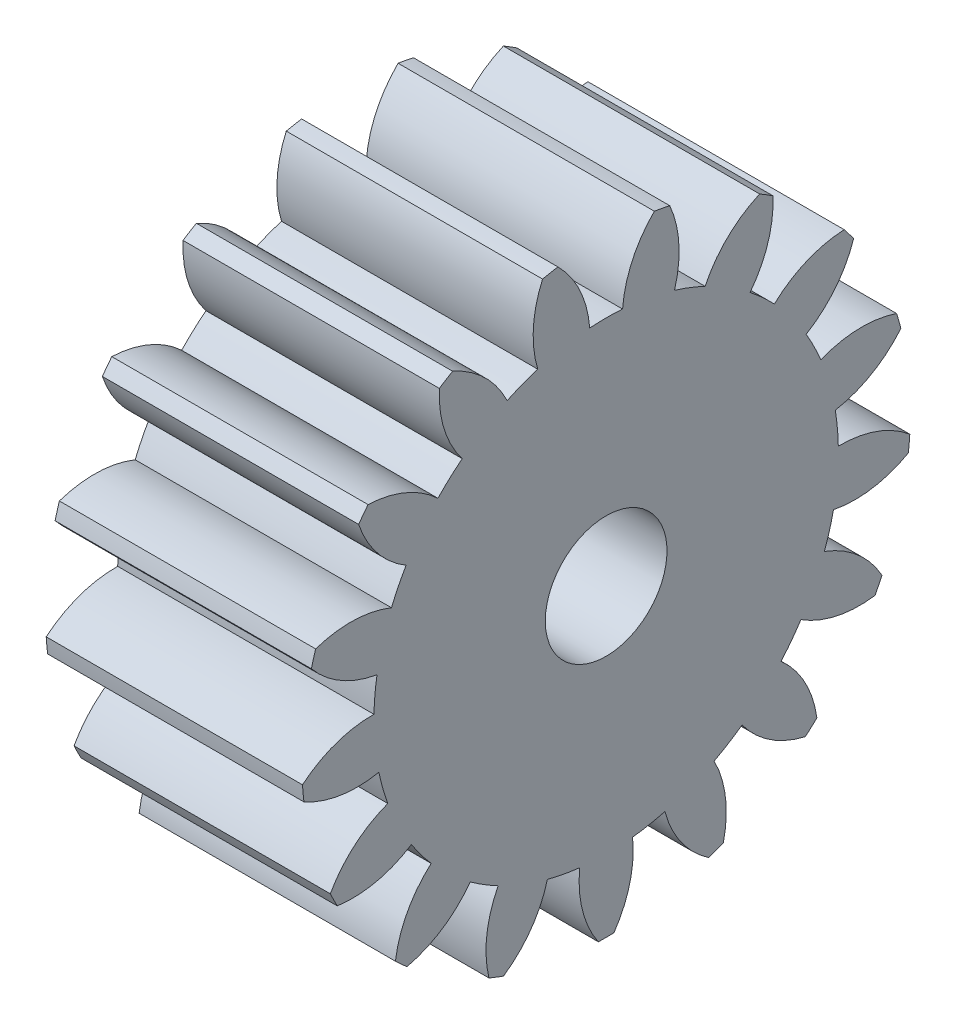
ISO-10303-21;
HEADER;
FILE_DESCRIPTION(('STEP AP214'),'2;1');
FILE_NAME('part.step','',(''),(''),'','','');
FILE_SCHEMA(('AUTOMOTIVE_DESIGN { 1 0 10303 214 1 1 1 1 }'));
ENDSEC;
DATA;
#1=APPLICATION_CONTEXT('core data for automotive mechanical design processes');
#2=APPLICATION_PROTOCOL_DEFINITION('international standard','automotive_design',2000,#1);
#3=PRODUCT_CONTEXT('',#1,'mechanical');
#4=PRODUCT('Part','Part','',(#3));
#5=PRODUCT_RELATED_PRODUCT_CATEGORY('part','',(#4));
#6=PRODUCT_DEFINITION_FORMATION('','',#4);
#7=PRODUCT_DEFINITION_CONTEXT('part definition',#1,'design');
#8=PRODUCT_DEFINITION('design','',#6,#7);
#9=PRODUCT_DEFINITION_SHAPE('','',#8);
#10=(LENGTH_UNIT() NAMED_UNIT(*) SI_UNIT(.MILLI.,.METRE.));
#11=(NAMED_UNIT(*) PLANE_ANGLE_UNIT() SI_UNIT($,.RADIAN.));
#12=(NAMED_UNIT(*) SI_UNIT($,.STERADIAN.) SOLID_ANGLE_UNIT());
#13=UNCERTAINTY_MEASURE_WITH_UNIT(LENGTH_MEASURE(1.E-05),#10,'distance_accuracy_value','');
#14=(GEOMETRIC_REPRESENTATION_CONTEXT(3) GLOBAL_UNCERTAINTY_ASSIGNED_CONTEXT((#13)) GLOBAL_UNIT_ASSIGNED_CONTEXT((#10,
#11,#12)) REPRESENTATION_CONTEXT('',''));
#15=CARTESIAN_POINT('',(0.,0.,0.));
#16=DIRECTION('',(0.,0.,1.));
#17=DIRECTION('',(1.,0.,0.));
#18=AXIS2_PLACEMENT_3D('',#15,#16,#17);
#19=CARTESIAN_POINT('',(12.,0.,0.));
#20=DIRECTION('',(-1.,0.,0.));
#21=DIRECTION('',(0.,0.,1.));
#22=AXIS2_PLACEMENT_3D('',#19,#20,#21);
#23=PLANE('',#22);
#24=CARTESIAN_POINT('',(12.,0.,0.));
#25=DIRECTION('',(-1.,0.,0.));
#26=DIRECTION('',(0.,0.,1.));
#27=AXIS2_PLACEMENT_3D('',#24,#25,#26);
#28=CIRCLE('',#27,2.85);
#29=CARTESIAN_POINT('',(12.,0.,2.85));
#30=VERTEX_POINT('',#29);
#31=EDGE_CURVE('E678',#30,#30,#28,.F.);
#32=ORIENTED_EDGE('',*,*,#31,.F.);
#33=EDGE_LOOP('',(#32));
#34=FACE_BOUND('',#33,.T.);
#35=CARTESIAN_POINT('',(12.,6.79371954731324,9.868722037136));
#36=DIRECTION('',(-1.,0.,0.));
#37=DIRECTION('',(0.,0.995734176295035,-0.0922683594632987));
#38=AXIS2_PLACEMENT_3D('',#35,#36,#37);
#39=CIRCLE('',#38,5.09999999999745);
#40=CARTESIAN_POINT('',(12.,1.76688404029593,10.7294919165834));
#41=VERTEX_POINT('',#40);
#42=CARTESIAN_POINT('',(12.,3.54675321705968,13.8015593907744));
#43=VERTEX_POINT('',#42);
#44=EDGE_CURVE('E500',#41,#43,#39,.T.);
#45=ORIENTED_EDGE('',*,*,#44,.F.);
#46=CARTESIAN_POINT('',(12.,0.,0.));
#47=DIRECTION('',(-1.,0.,0.));
#48=DIRECTION('',(0.,0.995734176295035,-0.0922683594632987));
#49=AXIS2_PLACEMENT_3D('',#46,#47,#48);
#50=CIRCLE('',#49,10.8739999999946);
#51=CARTESIAN_POINT('',(12.,0.234739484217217,10.8714660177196));
#52=VERTEX_POINT('',#51);
#53=EDGE_CURVE('E505',#52,#41,#50,.T.);
#54=ORIENTED_EDGE('',*,*,#53,.F.);
#55=CARTESIAN_POINT('',(12.,-4.86467064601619,10.9490309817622));
#56=DIRECTION('',(-1.,0.,0.));
#57=DIRECTION('',(0.,0.995734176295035,-0.0922683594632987));
#58=AXIS2_PLACEMENT_3D('',#55,#56,#57);
#59=CIRCLE('',#58,5.09999999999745);
#60=CARTESIAN_POINT('',(12.,-0.950333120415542,14.2182758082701));
#61=VERTEX_POINT('',#60);
#62=EDGE_CURVE('E502',#61,#52,#59,.T.);
#63=ORIENTED_EDGE('',*,*,#62,.F.);
#64=CARTESIAN_POINT('',(12.,0.,0.));
#65=DIRECTION('',(-1.,0.,0.));
#66=DIRECTION('',(0.,0.,1.));
#67=AXIS2_PLACEMENT_3D('',#64,#65,#66);
#68=CIRCLE('',#67,14.2499999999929);
#69=CARTESIAN_POINT('',(12.,-1.6784494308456,14.1508058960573));
#70=VERTEX_POINT('',#69);
#71=EDGE_CURVE('E971',#70,#61,#68,.T.);
#72=ORIENTED_EDGE('',*,*,#71,.F.);
#73=CARTESIAN_POINT('',(12.,2.76996122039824,11.6564838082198));
#74=DIRECTION('',(-1.,0.,0.));
#75=DIRECTION('',(0.,0.961825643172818,0.273662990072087));
#76=AXIS2_PLACEMENT_3D('',#73,#74,#75);
#77=CIRCLE('',#76,5.09999999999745);
#78=CARTESIAN_POINT('',(12.,-2.22836923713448,10.6432253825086));
#79=VERTEX_POINT('',#78);
#80=EDGE_CURVE('E584',#79,#70,#77,.T.);
#81=ORIENTED_EDGE('',*,*,#80,.F.);
#82=CARTESIAN_POINT('',(12.,0.,0.));
#83=DIRECTION('',(-1.,0.,0.));
#84=DIRECTION('',(0.,0.961825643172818,0.273662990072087));
#85=AXIS2_PLACEMENT_3D('',#82,#83,#84);
#86=CIRCLE('',#85,10.8739999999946);
#87=CARTESIAN_POINT('',(12.,-3.70833844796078,10.2221378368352));
#88=VERTEX_POINT('',#87);
#89=EDGE_CURVE('E589',#88,#79,#86,.T.);
#90=ORIENTED_EDGE('',*,*,#89,.F.);
#91=CARTESIAN_POINT('',(12.,-8.49141647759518,8.45234559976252));
#92=DIRECTION('',(-1.,0.,0.));
#93=DIRECTION('',(0.,0.961825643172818,0.273662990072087));
#94=AXIS2_PLACEMENT_3D('',#91,#92,#93);
#95=CIRCLE('',#94,5.09999999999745);
#96=CARTESIAN_POINT('',(12.,-6.02239288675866,12.9148474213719));
#97=VERTEX_POINT('',#96);
#98=EDGE_CURVE('E586',#97,#88,#95,.T.);
#99=ORIENTED_EDGE('',*,*,#98,.F.);
#100=CARTESIAN_POINT('',(12.,-6.67696818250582,12.5889076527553));
#101=VERTEX_POINT('',#100);
#102=EDGE_CURVE('E949',#101,#97,#68,.T.);
#103=ORIENTED_EDGE('',*,*,#102,.F.);
#104=CARTESIAN_POINT('',(12.,-1.62789571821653,11.8699728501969));
#105=DIRECTION('',(-1.,0.,0.));
#106=DIRECTION('',(0.,0.798017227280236,0.602634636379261));
#107=AXIS2_PLACEMENT_3D('',#104,#105,#106);
#108=CIRCLE('',#107,5.09999999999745);
#109=CARTESIAN_POINT('',(12.,-5.92266890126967,9.11953228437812));
#110=VERTEX_POINT('',#109);
#111=EDGE_CURVE('E567',#110,#101,#108,.T.);
#112=ORIENTED_EDGE('',*,*,#111,.F.);
#113=CARTESIAN_POINT('',(12.,0.,0.));
#114=DIRECTION('',(-1.,0.,0.));
#115=DIRECTION('',(0.,0.798017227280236,0.602634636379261));
#116=AXIS2_PLACEMENT_3D('',#113,#114,#115);
#117=CIRCLE('',#116,10.8739999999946);
#118=CARTESIAN_POINT('',(12.,-7.15058472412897,8.19225329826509));
#119=VERTEX_POINT('',#118);
#120=EDGE_CURVE('E572',#119,#110,#117,.T.);
#121=ORIENTED_EDGE('',*,*,#120,.F.);
#122=CARTESIAN_POINT('',(12.,-10.9713494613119,4.81412410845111));
#123=DIRECTION('',(-1.,0.,0.));
#124=DIRECTION('',(0.,0.798017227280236,0.602634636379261));
#125=AXIS2_PLACEMENT_3D('',#122,#123,#124);
#126=CIRCLE('',#125,5.09999999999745);
#127=CARTESIAN_POINT('',(12.,-10.281095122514,9.86719732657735));
#128=VERTEX_POINT('',#127);
#129=EDGE_CURVE('E569',#128,#119,#126,.T.);
#130=ORIENTED_EDGE('',*,*,#129,.F.);
#131=CARTESIAN_POINT('',(12.,-10.7737253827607,9.32680767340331));
#132=VERTEX_POINT('',#131);
#133=EDGE_CURVE('E1043',#132,#128,#68,.T.);
#134=ORIENTED_EDGE('',*,*,#133,.F.);
#135=CARTESIAN_POINT('',(12.,-5.80589631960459,10.4803562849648));
#136=DIRECTION('',(-1.,0.,0.));
#137=DIRECTION('',(0.,0.526432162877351,0.850217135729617));
#138=AXIS2_PLACEMENT_3D('',#135,#136,#137);
#139=CIRCLE('',#138,5.09999999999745);
#140=CARTESIAN_POINT('',(12.,-8.81707931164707,6.36419581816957));
#141=VERTEX_POINT('',#140);
#142=EDGE_CURVE('E531',#141,#132,#139,.T.);
#143=ORIENTED_EDGE('',*,*,#142,.F.);
#144=CARTESIAN_POINT('',(12.,0.,0.));
#145=DIRECTION('',(-1.,0.,0.));
#146=DIRECTION('',(0.,0.526432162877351,0.850217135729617));
#147=AXIS2_PLACEMENT_3D('',#144,#145,#146);
#148=CIRCLE('',#147,10.8739999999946);
#149=CARTESIAN_POINT('',(12.,-9.62710491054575,5.05595955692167));
#150=VERTEX_POINT('',#149);
#151=EDGE_CURVE('E536',#150,#141,#148,.T.);
#152=ORIENTED_EDGE('',*,*,#151,.F.);
#153=CARTESIAN_POINT('',(12.,-11.9695409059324,0.525728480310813));
#154=DIRECTION('',(-1.,0.,0.));
#155=DIRECTION('',(0.,0.526432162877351,0.850217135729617));
#156=AXIS2_PLACEMENT_3D('',#153,#154,#155);
#157=CIRCLE('',#156,5.09999999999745);
#158=CARTESIAN_POINT('',(12.,-13.1512784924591,5.48692755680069));
#159=VERTEX_POINT('',#158);
#160=EDGE_CURVE('E533',#159,#150,#157,.T.);
#161=ORIENTED_EDGE('',*,*,#160,.F.);
#162=CARTESIAN_POINT('',(12.,-13.4154312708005,4.80507063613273));
#163=VERTEX_POINT('',#162);
#164=EDGE_CURVE('E1037',#163,#159,#68,.T.);
#165=ORIENTED_EDGE('',*,*,#164,.F.);
#166=CARTESIAN_POINT('',(12.,-9.19977845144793,7.67530952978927));
#167=DIRECTION('',(-1.,0.,0.));
#168=DIRECTION('',(0.,0.183749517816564,0.982973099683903));
#169=AXIS2_PLACEMENT_3D('',#166,#167,#168);
#170=CIRCLE('',#169,5.09999999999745);
#171=CARTESIAN_POINT('',(12.,-10.5206943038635,2.74933944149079));
#172=VERTEX_POINT('',#171);
#173=EDGE_CURVE('E550',#172,#163,#170,.T.);
#174=ORIENTED_EDGE('',*,*,#173,.F.);
#175=CARTESIAN_POINT('',(12.,0.,0.));
#176=DIRECTION('',(-1.,0.,0.));
#177=DIRECTION('',(0.,0.183749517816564,0.982973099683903));
#178=AXIS2_PLACEMENT_3D('',#175,#176,#177);
#179=CIRCLE('',#178,10.8739999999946);
#180=CARTESIAN_POINT('',(12.,-10.8034312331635,1.23683046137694));
#181=VERTEX_POINT('',#180);
#182=EDGE_CURVE('E555',#181,#172,#179,.T.);
#183=ORIENTED_EDGE('',*,*,#182,.F.);
#184=CARTESIAN_POINT('',(12.,-11.351179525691,-3.83366969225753));
#185=DIRECTION('',(-1.,0.,0.));
#186=DIRECTION('',(0.,0.183749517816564,0.982973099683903));
#187=AXIS2_PLACEMENT_3D('',#184,#185,#186);
#188=CIRCLE('',#187,5.09999999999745);
#189=CARTESIAN_POINT('',(12.,-14.2453088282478,0.365617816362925));
#190=VERTEX_POINT('',#189);
#191=EDGE_CURVE('E552',#190,#181,#188,.T.);
#192=ORIENTED_EDGE('',*,*,#191,.F.);
#193=CARTESIAN_POINT('',(12.,-14.2453088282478,-0.365617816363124));
#194=VERTEX_POINT('',#193);
#195=EDGE_CURVE('E1031',#194,#190,#68,.T.);
#196=ORIENTED_EDGE('',*,*,#195,.F.);
#197=CARTESIAN_POINT('',(12.,-11.351179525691,3.83366969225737));
#198=DIRECTION('',(-1.,0.,0.));
#199=DIRECTION('',(0.,-0.183749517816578,0.9829730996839));
#200=AXIS2_PLACEMENT_3D('',#197,#198,#199);
#201=CIRCLE('',#200,5.09999999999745);
#202=CARTESIAN_POINT('',(12.,-10.8034312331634,-1.23683046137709));
#203=VERTEX_POINT('',#202);
#204=EDGE_CURVE('E635',#203,#194,#201,.T.);
#205=ORIENTED_EDGE('',*,*,#204,.F.);
#206=CARTESIAN_POINT('',(12.,0.,0.));
#207=DIRECTION('',(-1.,0.,0.));
#208=DIRECTION('',(0.,-0.183749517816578,0.9829730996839));
#209=AXIS2_PLACEMENT_3D('',#206,#207,#208);
#210=CIRCLE('',#209,10.8739999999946);
#211=CARTESIAN_POINT('',(12.,-10.5206943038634,-2.74933944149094));
#212=VERTEX_POINT('',#211);
#213=EDGE_CURVE('E640',#212,#203,#210,.T.);
#214=ORIENTED_EDGE('',*,*,#213,.F.);
#215=CARTESIAN_POINT('',(12.,-9.19977845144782,-7.6753095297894));
#216=DIRECTION('',(-1.,0.,0.));
#217=DIRECTION('',(0.,-0.183749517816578,0.9829730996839));
#218=AXIS2_PLACEMENT_3D('',#215,#216,#217);
#219=CIRCLE('',#218,5.09999999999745);
#220=CARTESIAN_POINT('',(12.,-13.4154312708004,-4.80507063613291));
#221=VERTEX_POINT('',#220);
#222=EDGE_CURVE('E637',#221,#212,#219,.T.);
#223=ORIENTED_EDGE('',*,*,#222,.F.);
#224=CARTESIAN_POINT('',(12.,-13.151278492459,-5.48692755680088));
#225=VERTEX_POINT('',#224);
#226=EDGE_CURVE('E1025',#225,#221,#68,.T.);
#227=ORIENTED_EDGE('',*,*,#226,.F.);
#228=CARTESIAN_POINT('',(12.,-11.9695409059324,-0.525728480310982));
#229=DIRECTION('',(-1.,0.,0.));
#230=DIRECTION('',(0.,-0.526432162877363,0.85021713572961));
#231=AXIS2_PLACEMENT_3D('',#228,#229,#230);
#232=CIRCLE('',#231,5.09999999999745);
#233=CARTESIAN_POINT('',(12.,-9.62710491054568,-5.05595955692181));
#234=VERTEX_POINT('',#233);
#235=EDGE_CURVE('E652',#234,#225,#232,.T.);
#236=ORIENTED_EDGE('',*,*,#235,.F.);
#237=CARTESIAN_POINT('',(12.,0.,0.));
#238=DIRECTION('',(-1.,0.,0.));
#239=DIRECTION('',(0.,-0.526432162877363,0.85021713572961));
#240=AXIS2_PLACEMENT_3D('',#237,#238,#239);
#241=CIRCLE('',#240,10.8739999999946);
#242=CARTESIAN_POINT('',(12.,-8.81707931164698,-6.36419581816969));
#243=VERTEX_POINT('',#242);
#244=EDGE_CURVE('E657',#243,#234,#241,.T.);
#245=ORIENTED_EDGE('',*,*,#244,.F.);
#246=CARTESIAN_POINT('',(12.,-5.80589631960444,-10.4803562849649));
#247=DIRECTION('',(-1.,0.,0.));
#248=DIRECTION('',(0.,-0.526432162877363,0.85021713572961));
#249=AXIS2_PLACEMENT_3D('',#246,#247,#248);
#250=CIRCLE('',#249,5.09999999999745);
#251=CARTESIAN_POINT('',(12.,-10.7737253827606,-9.32680767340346));
#252=VERTEX_POINT('',#251);
#253=EDGE_CURVE('E654',#252,#243,#250,.T.);
#254=ORIENTED_EDGE('',*,*,#253,.F.);
#255=CARTESIAN_POINT('',(12.,-10.2810951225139,-9.86719732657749));
#256=VERTEX_POINT('',#255);
#257=EDGE_CURVE('E1019',#256,#252,#68,.T.);
#258=ORIENTED_EDGE('',*,*,#257,.F.);
#259=CARTESIAN_POINT('',(12.,-10.9713494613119,-4.81412410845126));
#260=DIRECTION('',(-1.,0.,0.));
#261=DIRECTION('',(0.,-0.798017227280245,0.602634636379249));
#262=AXIS2_PLACEMENT_3D('',#259,#260,#261);
#263=CIRCLE('',#262,5.09999999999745);
#264=CARTESIAN_POINT('',(12.,-7.15058472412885,-8.19225329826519));
#265=VERTEX_POINT('',#264);
#266=EDGE_CURVE('E618',#265,#256,#263,.T.);
#267=ORIENTED_EDGE('',*,*,#266,.F.);
#268=CARTESIAN_POINT('',(12.,0.,0.));
#269=DIRECTION('',(-1.,0.,0.));
#270=DIRECTION('',(0.,-0.798017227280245,0.602634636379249));
#271=AXIS2_PLACEMENT_3D('',#268,#269,#270);
#272=CIRCLE('',#271,10.8739999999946);
#273=CARTESIAN_POINT('',(12.,-5.92266890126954,-9.11953228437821));
#274=VERTEX_POINT('',#273);
#275=EDGE_CURVE('E623',#274,#265,#272,.T.);
#276=ORIENTED_EDGE('',*,*,#275,.F.);
#277=CARTESIAN_POINT('',(12.,-1.62789571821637,-11.8699728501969));
#278=DIRECTION('',(-1.,0.,0.));
#279=DIRECTION('',(0.,-0.798017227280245,0.602634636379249));
#280=AXIS2_PLACEMENT_3D('',#277,#278,#279);
#281=CIRCLE('',#280,5.09999999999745);
#282=CARTESIAN_POINT('',(12.,-6.67696818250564,-12.5889076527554));
#283=VERTEX_POINT('',#282);
#284=EDGE_CURVE('E620',#283,#274,#281,.T.);
#285=ORIENTED_EDGE('',*,*,#284,.F.);
#286=CARTESIAN_POINT('',(12.,-6.02239288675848,-12.914847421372));
#287=VERTEX_POINT('',#286);
#288=EDGE_CURVE('E1013',#287,#283,#68,.T.);
#289=ORIENTED_EDGE('',*,*,#288,.F.);
#290=CARTESIAN_POINT('',(12.,-8.49141647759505,-8.45234559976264));
#291=DIRECTION('',(-1.,0.,0.));
#292=DIRECTION('',(0.,-0.961825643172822,0.273662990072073));
#293=AXIS2_PLACEMENT_3D('',#290,#291,#292);
#294=CIRCLE('',#293,5.09999999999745);
#295=CARTESIAN_POINT('',(12.,-3.70833844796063,-10.2221378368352));
#296=VERTEX_POINT('',#295);
#297=EDGE_CURVE('E599',#296,#287,#294,.T.);
#298=ORIENTED_EDGE('',*,*,#297,.F.);
#299=CARTESIAN_POINT('',(12.,0.,0.));
#300=DIRECTION('',(-1.,0.,0.));
#301=DIRECTION('',(0.,-0.961825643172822,0.273662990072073));
#302=AXIS2_PLACEMENT_3D('',#299,#300,#301);
#303=CIRCLE('',#302,10.8739999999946);
#304=CARTESIAN_POINT('',(12.,-2.22836923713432,-10.6432253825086));
#305=VERTEX_POINT('',#304);
#306=EDGE_CURVE('E604',#305,#296,#303,.T.);
#307=ORIENTED_EDGE('',*,*,#306,.F.);
#308=CARTESIAN_POINT('',(12.,2.76996122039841,-11.6564838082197));
#309=DIRECTION('',(-1.,0.,0.));
#310=DIRECTION('',(0.,-0.961825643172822,0.273662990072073));
#311=AXIS2_PLACEMENT_3D('',#308,#309,#310);
#312=CIRCLE('',#311,5.09999999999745);
#313=CARTESIAN_POINT('',(12.,-1.67844943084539,-14.1508058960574));
#314=VERTEX_POINT('',#313);
#315=EDGE_CURVE('E601',#314,#305,#312,.T.);
#316=ORIENTED_EDGE('',*,*,#315,.F.);
#317=CARTESIAN_POINT('',(12.,-0.95033312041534,-14.2182758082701));
#318=VERTEX_POINT('',#317);
#319=EDGE_CURVE('E1007',#318,#314,#68,.T.);
#320=ORIENTED_EDGE('',*,*,#319,.F.);
#321=CARTESIAN_POINT('',(12.,-4.86467064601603,-10.9490309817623));
#322=DIRECTION('',(-1.,0.,0.));
#323=DIRECTION('',(0.,-0.995734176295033,-0.092268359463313));
#324=AXIS2_PLACEMENT_3D('',#321,#322,#323);
#325=CIRCLE('',#324,5.09999999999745);
#326=CARTESIAN_POINT('',(12.,0.234739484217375,-10.8714660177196));
#327=VERTEX_POINT('',#326);
#328=EDGE_CURVE('E703',#327,#318,#325,.T.);
#329=ORIENTED_EDGE('',*,*,#328,.F.);
#330=CARTESIAN_POINT('',(12.,0.,0.));
#331=DIRECTION('',(-1.,0.,0.));
#332=DIRECTION('',(0.,-0.995734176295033,-0.092268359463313));
#333=AXIS2_PLACEMENT_3D('',#330,#331,#332);
#334=CIRCLE('',#333,10.8739999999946);
#335=CARTESIAN_POINT('',(12.,1.76688404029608,-10.7294919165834));
#336=VERTEX_POINT('',#335);
#337=EDGE_CURVE('E708',#336,#327,#334,.T.);
#338=ORIENTED_EDGE('',*,*,#337,.F.);
#339=CARTESIAN_POINT('',(12.,6.79371954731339,-9.86872203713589));
#340=DIRECTION('',(-1.,0.,0.));
#341=DIRECTION('',(0.,-0.995734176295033,-0.092268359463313));
#342=AXIS2_PLACEMENT_3D('',#339,#340,#341);
#343=CIRCLE('',#342,5.09999999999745);
#344=CARTESIAN_POINT('',(12.,3.54675321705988,-13.8015593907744));
#345=VERTEX_POINT('',#344);
#346=EDGE_CURVE('E705',#345,#336,#343,.T.);
#347=ORIENTED_EDGE('',*,*,#346,.F.);
#348=CARTESIAN_POINT('',(12.,4.2500743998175,-13.6014472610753));
#349=VERTEX_POINT('',#348);
#350=EDGE_CURVE('E1001',#349,#345,#68,.T.);
#351=ORIENTED_EDGE('',*,*,#350,.F.);
#352=CARTESIAN_POINT('',(12.,-0.58092408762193,-11.9669890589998));
#353=DIRECTION('',(-1.,0.,0.));
#354=DIRECTION('',(0.,-0.895163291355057,-0.445738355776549));
#355=AXIS2_PLACEMENT_3D('',#352,#353,#354);
#356=CIRCLE('',#355,5.09999999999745);
#357=CARTESIAN_POINT('',(12.,4.14611454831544,-10.052542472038));
#358=VERTEX_POINT('',#357);
#359=EDGE_CURVE('E720',#358,#349,#356,.T.);
#360=ORIENTED_EDGE('',*,*,#359,.F.);
#361=CARTESIAN_POINT('',(12.,0.,0.));
#362=DIRECTION('',(-1.,0.,0.));
#363=DIRECTION('',(0.,-0.895163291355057,-0.445738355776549));
#364=AXIS2_PLACEMENT_3D('',#361,#362,#363);
#365=CIRCLE('',#364,10.8739999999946);
#366=CARTESIAN_POINT('',(12.,5.52350983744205,-9.36668111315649));
#367=VERTEX_POINT('',#366);
#368=EDGE_CURVE('E725',#367,#358,#365,.T.);
#369=ORIENTED_EDGE('',*,*,#368,.F.);
#370=CARTESIAN_POINT('',(12.,9.89994840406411,-6.74813467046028));
#371=DIRECTION('',(-1.,0.,0.));
#372=DIRECTION('',(0.,-0.895163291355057,-0.445738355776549));
#373=AXIS2_PLACEMENT_3D('',#370,#371,#372);
#374=CIRCLE('',#373,5.09999999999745);
#375=CARTESIAN_POINT('',(12.,8.29294718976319,-11.5883358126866));
#376=VERTEX_POINT('',#375);
#377=EDGE_CURVE('E722',#376,#367,#374,.T.);
#378=ORIENTED_EDGE('',*,*,#377,.F.);
#379=CARTESIAN_POINT('',(12.,8.87648582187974,-11.1476678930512));
#380=VERTEX_POINT('',#379);
#381=EDGE_CURVE('E995',#380,#376,#68,.T.);
#382=ORIENTED_EDGE('',*,*,#381,.F.);
#383=CARTESIAN_POINT('',(12.,3.781279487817,-11.3687389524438));
#384=DIRECTION('',(-1.,0.,0.));
#385=DIRECTION('',(0.,-0.673695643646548,-0.739008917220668));
#386=AXIS2_PLACEMENT_3D('',#383,#384,#385);
#387=CIRCLE('',#386,5.09999999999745);
#388=CARTESIAN_POINT('',(12.,7.49753386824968,-7.87596736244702));
#389=VERTEX_POINT('',#388);
#390=EDGE_CURVE('E686',#389,#380,#387,.T.);
#391=ORIENTED_EDGE('',*,*,#390,.F.);
#392=CARTESIAN_POINT('',(12.,0.,0.));
#393=DIRECTION('',(-1.,0.,0.));
#394=DIRECTION('',(0.,-0.673695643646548,-0.739008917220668));
#395=AXIS2_PLACEMENT_3D('',#392,#393,#394);
#396=CIRCLE('',#395,10.8739999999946);
#397=CARTESIAN_POINT('',(12.,8.53415502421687,-6.73884812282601));
#398=VERTEX_POINT('',#397);
#399=EDGE_CURVE('E691',#398,#389,#396,.T.);
#400=ORIENTED_EDGE('',*,*,#399,.F.);
#401=CARTESIAN_POINT('',(12.,11.6691343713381,-2.71617432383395));
#402=DIRECTION('',(-1.,0.,0.));
#403=DIRECTION('',(0.,-0.673695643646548,-0.739008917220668));
#404=AXIS2_PLACEMENT_3D('',#401,#402,#403);
#405=CIRCLE('',#404,5.09999999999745);
#406=CARTESIAN_POINT('',(12.,11.9191326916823,-7.81004326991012));
#407=VERTEX_POINT('',#406);
#408=EDGE_CURVE('E688',#407,#398,#405,.T.);
#409=ORIENTED_EDGE('',*,*,#408,.F.);
#410=CARTESIAN_POINT('',(12.,12.3040786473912,-7.18833420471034));
#411=VERTEX_POINT('',#410);
#412=EDGE_CURVE('E848',#411,#407,#68,.T.);
#413=ORIENTED_EDGE('',*,*,#412,.F.);
#414=CARTESIAN_POINT('',(12.,7.63280031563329,-9.23507765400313));
#415=DIRECTION('',(-1.,0.,0.));
#416=DIRECTION('',(0.,-0.361241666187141,-0.932472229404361));
#417=AXIS2_PLACEMENT_3D('',#414,#415,#416);
#418=CIRCLE('',#417,5.09999999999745);
#419=CARTESIAN_POINT('',(12.,9.83636969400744,-4.63569921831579));
#420=VERTEX_POINT('',#419);
#421=EDGE_CURVE('E667',#420,#411,#418,.T.);
#422=ORIENTED_EDGE('',*,*,#421,.F.);
#423=CARTESIAN_POINT('',(12.,0.,0.));
#424=DIRECTION('',(-1.,0.,0.));
#425=DIRECTION('',(0.,-0.361241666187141,-0.932472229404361));
#426=AXIS2_PLACEMENT_3D('',#423,#424,#425);
#427=CIRCLE('',#426,10.8739999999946);
#428=CARTESIAN_POINT('',(12.,10.3922152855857,-3.20089635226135));
#429=VERTEX_POINT('',#428);
#430=EDGE_CURVE('E672',#429,#420,#427,.T.);
#431=ORIENTED_EDGE('',*,*,#430,.F.);
#432=CARTESIAN_POINT('',(12.,11.8623390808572,1.68262041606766));
#433=DIRECTION('',(-1.,0.,0.));
#434=DIRECTION('',(0.,-0.361241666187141,-0.932472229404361));
#435=AXIS2_PLACEMENT_3D('',#432,#433,#434);
#436=CIRCLE('',#435,5.09999999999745);
#437=CARTESIAN_POINT('',(12.,13.9355732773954,-2.9769611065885));
#438=VERTEX_POINT('',#437);
#439=EDGE_CURVE('E669',#438,#429,#436,.T.);
#440=ORIENTED_EDGE('',*,*,#439,.F.);
#441=CARTESIAN_POINT('',(12.,14.069937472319,-2.25817615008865));
#442=VERTEX_POINT('',#441);
#443=EDGE_CURVE('E844',#442,#438,#68,.T.);
#444=ORIENTED_EDGE('',*,*,#443,.F.);
#445=CARTESIAN_POINT('',(12.,10.4534691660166,-5.85416794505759));
#446=DIRECTION('',(-1.,0.,0.));
#447=DIRECTION('',(0.,0.,-1.));
#448=AXIS2_PLACEMENT_3D('',#445,#446,#447);
#449=CIRCLE('',#448,5.09999999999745);
#450=CARTESIAN_POINT('',(12.,10.8467492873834,-0.769354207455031));
#451=VERTEX_POINT('',#450);
#452=EDGE_CURVE('E816',#451,#442,#449,.T.);
#453=ORIENTED_EDGE('',*,*,#452,.F.);
#454=CARTESIAN_POINT('',(12.,0.,0.));
#455=DIRECTION('',(-1.,0.,0.));
#456=DIRECTION('',(0.,0.,-1.));
#457=AXIS2_PLACEMENT_3D('',#454,#455,#456);
#458=CIRCLE('',#457,10.8739999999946);
#459=CARTESIAN_POINT('',(12.,10.8467492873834,0.769354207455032));
#460=VERTEX_POINT('',#459);
#461=EDGE_CURVE('E821',#460,#451,#458,.T.);
#462=ORIENTED_EDGE('',*,*,#461,.F.);
#463=CARTESIAN_POINT('',(12.,10.4534691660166,5.85416794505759));
#464=DIRECTION('',(-1.,0.,0.));
#465=DIRECTION('',(0.,0.,-1.));
#466=AXIS2_PLACEMENT_3D('',#463,#464,#465);
#467=CIRCLE('',#466,5.09999999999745);
#468=CARTESIAN_POINT('',(12.,14.069937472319,2.25817615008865));
#469=VERTEX_POINT('',#468);
#470=EDGE_CURVE('E818',#469,#460,#467,.T.);
#471=ORIENTED_EDGE('',*,*,#470,.F.);
#472=CARTESIAN_POINT('',(12.,13.9355732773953,2.9769611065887));
#473=VERTEX_POINT('',#472);
#474=EDGE_CURVE('E841',#473,#469,#68,.T.);
#475=ORIENTED_EDGE('',*,*,#474,.F.);
#476=CARTESIAN_POINT('',(12.,11.8623390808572,-1.68262041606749));
#477=DIRECTION('',(-1.,0.,0.));
#478=DIRECTION('',(0.,0.361241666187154,-0.932472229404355));
#479=AXIS2_PLACEMENT_3D('',#476,#477,#478);
#480=CIRCLE('',#479,5.09999999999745);
#481=CARTESIAN_POINT('',(12.,10.3922152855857,3.2008963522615));
#482=VERTEX_POINT('',#481);
#483=EDGE_CURVE('E794',#482,#473,#480,.T.);
#484=ORIENTED_EDGE('',*,*,#483,.F.);
#485=CARTESIAN_POINT('',(12.,0.,0.));
#486=DIRECTION('',(-1.,0.,0.));
#487=DIRECTION('',(0.,0.361241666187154,-0.932472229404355));
#488=AXIS2_PLACEMENT_3D('',#485,#486,#487);
#489=CIRCLE('',#488,10.8739999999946);
#490=CARTESIAN_POINT('',(12.,9.83636969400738,4.63569921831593));
#491=VERTEX_POINT('',#490);
#492=EDGE_CURVE('E799',#491,#482,#489,.T.);
#493=ORIENTED_EDGE('',*,*,#492,.F.);
#494=CARTESIAN_POINT('',(12.,7.63280031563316,9.23507765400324));
#495=DIRECTION('',(-1.,0.,0.));
#496=DIRECTION('',(0.,0.361241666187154,-0.932472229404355));
#497=AXIS2_PLACEMENT_3D('',#494,#495,#496);
#498=CIRCLE('',#497,5.09999999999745);
#499=CARTESIAN_POINT('',(12.,12.3040786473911,7.18833420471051));
#500=VERTEX_POINT('',#499);
#501=EDGE_CURVE('E796',#500,#491,#498,.T.);
#502=ORIENTED_EDGE('',*,*,#501,.F.);
#503=CARTESIAN_POINT('',(12.,11.9191326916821,7.81004326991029));
#504=VERTEX_POINT('',#503);
#505=EDGE_CURVE('E849',#504,#500,#68,.T.);
#506=ORIENTED_EDGE('',*,*,#505,.F.);
#507=CARTESIAN_POINT('',(12.,11.6691343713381,2.71617432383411));
#508=DIRECTION('',(-1.,0.,0.));
#509=DIRECTION('',(0.,0.673695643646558,-0.739008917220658));
#510=AXIS2_PLACEMENT_3D('',#507,#508,#509);
#511=CIRCLE('',#510,5.09999999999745);
#512=CARTESIAN_POINT('',(12.,8.53415502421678,6.73884812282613));
#513=VERTEX_POINT('',#512);
#514=EDGE_CURVE('E514',#513,#504,#511,.T.);
#515=ORIENTED_EDGE('',*,*,#514,.F.);
#516=CARTESIAN_POINT('',(12.,0.,0.));
#517=DIRECTION('',(-1.,0.,0.));
#518=DIRECTION('',(0.,0.673695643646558,-0.739008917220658));
#519=AXIS2_PLACEMENT_3D('',#516,#517,#518);
#520=CIRCLE('',#519,10.8739999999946);
#521=CARTESIAN_POINT('',(12.,7.49753386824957,7.87596736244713));
#522=VERTEX_POINT('',#521);
#523=EDGE_CURVE('E519',#522,#513,#520,.T.);
#524=ORIENTED_EDGE('',*,*,#523,.F.);
#525=CARTESIAN_POINT('',(12.,3.78127948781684,11.3687389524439));
#526=DIRECTION('',(-1.,0.,0.));
#527=DIRECTION('',(0.,0.673695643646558,-0.739008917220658));
#528=AXIS2_PLACEMENT_3D('',#525,#526,#527);
#529=CIRCLE('',#528,5.09999999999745);
#530=CARTESIAN_POINT('',(12.,8.87648582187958,11.1476678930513));
#531=VERTEX_POINT('',#530);
#532=EDGE_CURVE('E516',#531,#522,#529,.T.);
#533=ORIENTED_EDGE('',*,*,#532,.F.);
#534=CARTESIAN_POINT('',(12.,8.29294718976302,11.5883358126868));
#535=VERTEX_POINT('',#534);
#536=EDGE_CURVE('E981',#535,#531,#68,.T.);
#537=ORIENTED_EDGE('',*,*,#536,.F.);
#538=CARTESIAN_POINT('',(12.,9.89994840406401,6.74813467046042));
#539=DIRECTION('',(-1.,0.,0.));
#540=DIRECTION('',(0.,0.895163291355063,-0.445738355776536));
#541=AXIS2_PLACEMENT_3D('',#538,#539,#540);
#542=CIRCLE('',#541,5.09999999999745);
#543=CARTESIAN_POINT('',(12.,5.52350983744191,9.36668111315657));
#544=VERTEX_POINT('',#543);
#545=EDGE_CURVE('E480',#544,#535,#542,.T.);
#546=ORIENTED_EDGE('',*,*,#545,.F.);
#547=CARTESIAN_POINT('',(12.,0.,0.));
#548=DIRECTION('',(-1.,0.,0.));
#549=DIRECTION('',(0.,0.895163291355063,-0.445738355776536));
#550=AXIS2_PLACEMENT_3D('',#547,#548,#549);
#551=CIRCLE('',#550,10.8739999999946);
#552=CARTESIAN_POINT('',(12.,4.14611454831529,10.0525424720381));
#553=VERTEX_POINT('',#552);
#554=EDGE_CURVE('E479',#553,#544,#551,.T.);
#555=ORIENTED_EDGE('',*,*,#554,.F.);
#556=CARTESIAN_POINT('',(12.,-0.580924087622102,11.9669890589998));
#557=DIRECTION('',(-1.,0.,0.));
#558=DIRECTION('',(0.,0.895163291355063,-0.445738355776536));
#559=AXIS2_PLACEMENT_3D('',#556,#557,#558);
#560=CIRCLE('',#559,5.09999999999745);
#561=CARTESIAN_POINT('',(12.,4.2500743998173,13.6014472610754));
#562=VERTEX_POINT('',#561);
#563=EDGE_CURVE('E468',#562,#553,#560,.T.);
#564=ORIENTED_EDGE('',*,*,#563,.F.);
#565=EDGE_CURVE('E888',#43,#562,#68,.T.);
#566=ORIENTED_EDGE('',*,*,#565,.F.);
#567=EDGE_LOOP('',(#45,#54,#63,#72,#81,#90,#99,#103,#112,#121,#130,#134,#143,#152,#161,#165,
#174,#183,#192,#196,#205,#214,#223,#227,#236,#245,#254,#258,#267,#276,#285,#289,#298,#307,#316,
#320,#329,#338,#347,#351,#360,#369,#378,#382,#391,#400,#409,#413,#422,#431,#440,#444,#453,#462,
#471,#475,#484,#493,#502,#506,#515,#524,#533,#537,#546,#555,#564,#566));
#568=FACE_BOUND('',#567,.T.);
#569=ADVANCED_FACE('F43',(#34,#568),#23,.F.);
#570=CARTESIAN_POINT('',(-10.,0.,0.));
#571=DIRECTION('',(-1.,0.,0.));
#572=DIRECTION('',(0.,0.,1.));
#573=AXIS2_PLACEMENT_3D('',#570,#571,#572);
#574=CYLINDRICAL_SURFACE('',#573,14.2499999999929);
#575=DIRECTION('',(-1.,0.,0.));
#576=VECTOR('',#575,1.);
#577=CARTESIAN_POINT('',(6.,3.54675321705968,13.8015593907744));
#578=LINE('',#577,#576);
#579=CARTESIAN_POINT('',(0.,3.54675321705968,13.8015593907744));
#580=VERTEX_POINT('',#579);
#581=EDGE_CURVE('E791',#43,#580,#578,.T.);
#582=ORIENTED_EDGE('',*,*,#581,.F.);
#583=ORIENTED_EDGE('',*,*,#565,.T.);
#584=DIRECTION('',(-1.,0.,0.));
#585=VECTOR('',#584,1.);
#586=CARTESIAN_POINT('',(6.,4.2500743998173,13.6014472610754));
#587=LINE('',#586,#585);
#588=CARTESIAN_POINT('',(0.,4.2500743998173,13.6014472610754));
#589=VERTEX_POINT('',#588);
#590=EDGE_CURVE('E474',#589,#562,#587,.F.);
#591=ORIENTED_EDGE('',*,*,#590,.F.);
#592=CARTESIAN_POINT('',(0.,0.,0.));
#593=DIRECTION('',(-1.,0.,0.));
#594=DIRECTION('',(0.,0.,1.));
#595=AXIS2_PLACEMENT_3D('',#592,#593,#594);
#596=CIRCLE('',#595,14.2499999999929);
#597=EDGE_CURVE('E887',#580,#589,#596,.T.);
#598=ORIENTED_EDGE('',*,*,#597,.F.);
#599=EDGE_LOOP('',(#582,#583,#591,#598));
#600=FACE_BOUND('',#599,.T.);
#601=ADVANCED_FACE('F886',(#600),#574,.T.);
#602=DIRECTION('',(-1.,0.,0.));
#603=VECTOR('',#602,1.);
#604=CARTESIAN_POINT('',(6.,-0.950333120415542,14.2182758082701));
#605=LINE('',#604,#603);
#606=CARTESIAN_POINT('',(0.,-0.950333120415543,14.2182758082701));
#607=VERTEX_POINT('',#606);
#608=EDGE_CURVE('E789',#607,#61,#605,.F.);
#609=ORIENTED_EDGE('',*,*,#608,.F.);
#610=CARTESIAN_POINT('',(0.,-1.6784494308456,14.1508058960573));
#611=VERTEX_POINT('',#610);
#612=EDGE_CURVE('E890',#611,#607,#596,.T.);
#613=ORIENTED_EDGE('',*,*,#612,.F.);
#614=DIRECTION('',(-1.,0.,0.));
#615=VECTOR('',#614,1.);
#616=CARTESIAN_POINT('',(6.,-1.6784494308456,14.1508058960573));
#617=LINE('',#616,#615);
#618=EDGE_CURVE('E772',#70,#611,#617,.T.);
#619=ORIENTED_EDGE('',*,*,#618,.F.);
#620=ORIENTED_EDGE('',*,*,#71,.T.);
#621=EDGE_LOOP('',(#609,#613,#619,#620));
#622=FACE_BOUND('',#621,.T.);
#623=ADVANCED_FACE('F969',(#622),#574,.T.);
#624=DIRECTION('',(-1.,0.,0.));
#625=VECTOR('',#624,1.);
#626=CARTESIAN_POINT('',(6.,8.29294718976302,11.5883358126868));
#627=LINE('',#626,#625);
#628=CARTESIAN_POINT('',(0.,8.29294718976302,11.5883358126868));
#629=VERTEX_POINT('',#628);
#630=EDGE_CURVE('E787',#535,#629,#627,.T.);
#631=ORIENTED_EDGE('',*,*,#630,.F.);
#632=ORIENTED_EDGE('',*,*,#536,.T.);
#633=DIRECTION('',(-1.,0.,0.));
#634=VECTOR('',#633,1.);
#635=CARTESIAN_POINT('',(6.,8.87648582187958,11.1476678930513));
#636=LINE('',#635,#634);
#637=CARTESIAN_POINT('',(0.,8.87648582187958,11.1476678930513));
#638=VERTEX_POINT('',#637);
#639=EDGE_CURVE('E782',#638,#531,#636,.F.);
#640=ORIENTED_EDGE('',*,*,#639,.F.);
#641=EDGE_CURVE('E891',#629,#638,#596,.T.);
#642=ORIENTED_EDGE('',*,*,#641,.F.);
#643=EDGE_LOOP('',(#631,#632,#640,#642));
#644=FACE_BOUND('',#643,.T.);
#645=ADVANCED_FACE('F1093',(#644),#574,.T.);
#646=DIRECTION('',(-1.,0.,0.));
#647=VECTOR('',#646,1.);
#648=CARTESIAN_POINT('',(6.,11.9191326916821,7.81004326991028));
#649=LINE('',#648,#647);
#650=CARTESIAN_POINT('',(0.,11.9191326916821,7.81004326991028));
#651=VERTEX_POINT('',#650);
#652=EDGE_CURVE('E784',#504,#651,#649,.T.);
#653=ORIENTED_EDGE('',*,*,#652,.F.);
#654=ORIENTED_EDGE('',*,*,#505,.T.);
#655=DIRECTION('',(-1.,0.,0.));
#656=VECTOR('',#655,1.);
#657=CARTESIAN_POINT('',(6.,12.3040786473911,7.18833420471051));
#658=LINE('',#657,#656);
#659=CARTESIAN_POINT('',(0.,12.3040786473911,7.18833420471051));
#660=VERTEX_POINT('',#659);
#661=EDGE_CURVE('E810',#660,#500,#658,.F.);
#662=ORIENTED_EDGE('',*,*,#661,.F.);
#663=EDGE_CURVE('E843',#651,#660,#596,.T.);
#664=ORIENTED_EDGE('',*,*,#663,.F.);
#665=EDGE_LOOP('',(#653,#654,#662,#664));
#666=FACE_BOUND('',#665,.T.);
#667=ADVANCED_FACE('F1105',(#666),#574,.T.);
#668=DIRECTION('',(-1.,0.,0.));
#669=VECTOR('',#668,1.);
#670=CARTESIAN_POINT('',(6.,-13.4154312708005,4.80507063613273));
#671=LINE('',#670,#669);
#672=CARTESIAN_POINT('',(0.,-13.4154312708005,4.80507063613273));
#673=VERTEX_POINT('',#672);
#674=EDGE_CURVE('E780',#163,#673,#671,.T.);
#675=ORIENTED_EDGE('',*,*,#674,.F.);
#676=ORIENTED_EDGE('',*,*,#164,.T.);
#677=DIRECTION('',(-1.,0.,0.));
#678=VECTOR('',#677,1.);
#679=CARTESIAN_POINT('',(6.,-13.1512784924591,5.48692755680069));
#680=LINE('',#679,#678);
#681=CARTESIAN_POINT('',(0.,-13.1512784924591,5.48692755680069));
#682=VERTEX_POINT('',#681);
#683=EDGE_CURVE('E774',#682,#159,#680,.F.);
#684=ORIENTED_EDGE('',*,*,#683,.F.);
#685=EDGE_CURVE('E930',#673,#682,#596,.T.);
#686=ORIENTED_EDGE('',*,*,#685,.F.);
#687=EDGE_LOOP('',(#675,#676,#684,#686));
#688=FACE_BOUND('',#687,.T.);
#689=ADVANCED_FACE('F1250',(#688),#574,.T.);
#690=DIRECTION('',(-1.,0.,0.));
#691=VECTOR('',#690,1.);
#692=CARTESIAN_POINT('',(6.,-14.2453088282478,0.365617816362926));
#693=LINE('',#692,#691);
#694=CARTESIAN_POINT('',(0.,-14.2453088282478,0.365617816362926));
#695=VERTEX_POINT('',#694);
#696=EDGE_CURVE('E778',#695,#190,#693,.F.);
#697=ORIENTED_EDGE('',*,*,#696,.F.);
#698=CARTESIAN_POINT('',(0.,-14.2453088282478,-0.365617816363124));
#699=VERTEX_POINT('',#698);
#700=EDGE_CURVE('E926',#699,#695,#596,.T.);
#701=ORIENTED_EDGE('',*,*,#700,.F.);
#702=DIRECTION('',(-1.,0.,0.));
#703=VECTOR('',#702,1.);
#704=CARTESIAN_POINT('',(6.,-14.2453088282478,-0.365617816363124));
#705=LINE('',#704,#703);
#706=EDGE_CURVE('E752',#194,#699,#705,.T.);
#707=ORIENTED_EDGE('',*,*,#706,.F.);
#708=ORIENTED_EDGE('',*,*,#195,.T.);
#709=EDGE_LOOP('',(#697,#701,#707,#708));
#710=FACE_BOUND('',#709,.T.);
#711=ADVANCED_FACE('F1237',(#710),#574,.T.);
#712=DIRECTION('',(-1.,0.,0.));
#713=VECTOR('',#712,1.);
#714=CARTESIAN_POINT('',(6.,-10.7737253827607,9.32680767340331));
#715=LINE('',#714,#713);
#716=CARTESIAN_POINT('',(0.,-10.7737253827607,9.32680767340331));
#717=VERTEX_POINT('',#716);
#718=EDGE_CURVE('E776',#132,#717,#715,.T.);
#719=ORIENTED_EDGE('',*,*,#718,.F.);
#720=ORIENTED_EDGE('',*,*,#133,.T.);
#721=DIRECTION('',(-1.,0.,0.));
#722=VECTOR('',#721,1.);
#723=CARTESIAN_POINT('',(6.,-10.281095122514,9.86719732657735));
#724=LINE('',#723,#722);
#725=CARTESIAN_POINT('',(0.,-10.281095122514,9.86719732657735));
#726=VERTEX_POINT('',#725);
#727=EDGE_CURVE('E766',#726,#128,#724,.F.);
#728=ORIENTED_EDGE('',*,*,#727,.F.);
#729=EDGE_CURVE('E934',#717,#726,#596,.T.);
#730=ORIENTED_EDGE('',*,*,#729,.F.);
#731=EDGE_LOOP('',(#719,#720,#728,#730));
#732=FACE_BOUND('',#731,.T.);
#733=ADVANCED_FACE('F1053',(#732),#574,.T.);
#734=DIRECTION('',(-1.,0.,0.));
#735=VECTOR('',#734,1.);
#736=CARTESIAN_POINT('',(6.,-6.02239288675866,12.9148474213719));
#737=LINE('',#736,#735);
#738=CARTESIAN_POINT('',(0.,-6.02239288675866,12.9148474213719));
#739=VERTEX_POINT('',#738);
#740=EDGE_CURVE('E770',#739,#97,#737,.F.);
#741=ORIENTED_EDGE('',*,*,#740,.F.);
#742=CARTESIAN_POINT('',(0.,-6.67696818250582,12.5889076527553));
#743=VERTEX_POINT('',#742);
#744=EDGE_CURVE('E893',#743,#739,#596,.T.);
#745=ORIENTED_EDGE('',*,*,#744,.F.);
#746=DIRECTION('',(-1.,0.,0.));
#747=VECTOR('',#746,1.);
#748=CARTESIAN_POINT('',(6.,-6.67696818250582,12.5889076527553));
#749=LINE('',#748,#747);
#750=EDGE_CURVE('E768',#101,#743,#749,.T.);
#751=ORIENTED_EDGE('',*,*,#750,.F.);
#752=ORIENTED_EDGE('',*,*,#102,.T.);
#753=EDGE_LOOP('',(#741,#745,#751,#752));
#754=FACE_BOUND('',#753,.T.);
#755=ADVANCED_FACE('F946',(#754),#574,.T.);
#756=DIRECTION('',(-1.,0.,0.));
#757=VECTOR('',#756,1.);
#758=CARTESIAN_POINT('',(6.,-10.2810951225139,-9.86719732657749));
#759=LINE('',#758,#757);
#760=CARTESIAN_POINT('',(0.,-10.2810951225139,-9.86719732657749));
#761=VERTEX_POINT('',#760);
#762=EDGE_CURVE('E764',#256,#761,#759,.T.);
#763=ORIENTED_EDGE('',*,*,#762,.F.);
#764=ORIENTED_EDGE('',*,*,#257,.T.);
#765=DIRECTION('',(-1.,0.,0.));
#766=VECTOR('',#765,1.);
#767=CARTESIAN_POINT('',(6.,-10.7737253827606,-9.32680767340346));
#768=LINE('',#767,#766);
#769=CARTESIAN_POINT('',(0.,-10.7737253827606,-9.32680767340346));
#770=VERTEX_POINT('',#769);
#771=EDGE_CURVE('E754',#770,#252,#768,.F.);
#772=ORIENTED_EDGE('',*,*,#771,.F.);
#773=EDGE_CURVE('E918',#761,#770,#596,.T.);
#774=ORIENTED_EDGE('',*,*,#773,.F.);
#775=EDGE_LOOP('',(#763,#764,#772,#774));
#776=FACE_BOUND('',#775,.T.);
#777=ADVANCED_FACE('F1211',(#776),#574,.T.);
#778=DIRECTION('',(-1.,0.,0.));
#779=VECTOR('',#778,1.);
#780=CARTESIAN_POINT('',(6.,-6.67696818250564,-12.5889076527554));
#781=LINE('',#780,#779);
#782=CARTESIAN_POINT('',(0.,-6.67696818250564,-12.5889076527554));
#783=VERTEX_POINT('',#782);
#784=EDGE_CURVE('E762',#783,#283,#781,.F.);
#785=ORIENTED_EDGE('',*,*,#784,.F.);
#786=CARTESIAN_POINT('',(0.,-6.02239288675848,-12.914847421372));
#787=VERTEX_POINT('',#786);
#788=EDGE_CURVE('E914',#787,#783,#596,.T.);
#789=ORIENTED_EDGE('',*,*,#788,.F.);
#790=DIRECTION('',(-1.,0.,0.));
#791=VECTOR('',#790,1.);
#792=CARTESIAN_POINT('',(6.,-6.02239288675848,-12.914847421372));
#793=LINE('',#792,#791);
#794=EDGE_CURVE('E760',#287,#787,#793,.T.);
#795=ORIENTED_EDGE('',*,*,#794,.F.);
#796=ORIENTED_EDGE('',*,*,#288,.T.);
#797=EDGE_LOOP('',(#785,#789,#795,#796));
#798=FACE_BOUND('',#797,.T.);
#799=ADVANCED_FACE('F1201',(#798),#574,.T.);
#800=DIRECTION('',(-1.,0.,0.));
#801=VECTOR('',#800,1.);
#802=CARTESIAN_POINT('',(6.,-1.67844943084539,-14.1508058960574));
#803=LINE('',#802,#801);
#804=CARTESIAN_POINT('',(0.,-1.67844943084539,-14.1508058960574));
#805=VERTEX_POINT('',#804);
#806=EDGE_CURVE('E758',#805,#314,#803,.F.);
#807=ORIENTED_EDGE('',*,*,#806,.F.);
#808=CARTESIAN_POINT('',(0.,-0.95033312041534,-14.2182758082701));
#809=VERTEX_POINT('',#808);
#810=EDGE_CURVE('E910',#809,#805,#596,.T.);
#811=ORIENTED_EDGE('',*,*,#810,.F.);
#812=DIRECTION('',(-1.,0.,0.));
#813=VECTOR('',#812,1.);
#814=CARTESIAN_POINT('',(6.,-0.95033312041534,-14.2182758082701));
#815=LINE('',#814,#813);
#816=EDGE_CURVE('E736',#318,#809,#815,.T.);
#817=ORIENTED_EDGE('',*,*,#816,.F.);
#818=ORIENTED_EDGE('',*,*,#319,.T.);
#819=EDGE_LOOP('',(#807,#811,#817,#818));
#820=FACE_BOUND('',#819,.T.);
#821=ADVANCED_FACE('F1188',(#820),#574,.T.);
#822=DIRECTION('',(-1.,0.,0.));
#823=VECTOR('',#822,1.);
#824=CARTESIAN_POINT('',(6.,-13.151278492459,-5.48692755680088));
#825=LINE('',#824,#823);
#826=CARTESIAN_POINT('',(0.,-13.151278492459,-5.48692755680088));
#827=VERTEX_POINT('',#826);
#828=EDGE_CURVE('E756',#225,#827,#825,.T.);
#829=ORIENTED_EDGE('',*,*,#828,.F.);
#830=ORIENTED_EDGE('',*,*,#226,.T.);
#831=DIRECTION('',(-1.,0.,0.));
#832=VECTOR('',#831,1.);
#833=CARTESIAN_POINT('',(6.,-13.4154312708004,-4.80507063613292));
#834=LINE('',#833,#832);
#835=CARTESIAN_POINT('',(0.,-13.4154312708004,-4.80507063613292));
#836=VERTEX_POINT('',#835);
#837=EDGE_CURVE('E750',#836,#221,#834,.F.);
#838=ORIENTED_EDGE('',*,*,#837,.F.);
#839=EDGE_CURVE('E922',#827,#836,#596,.T.);
#840=ORIENTED_EDGE('',*,*,#839,.F.);
#841=EDGE_LOOP('',(#829,#830,#838,#840));
#842=FACE_BOUND('',#841,.T.);
#843=ADVANCED_FACE('F1224',(#842),#574,.T.);
#844=DIRECTION('',(-1.,0.,0.));
#845=VECTOR('',#844,1.);
#846=CARTESIAN_POINT('',(6.,8.87648582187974,-11.1476678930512));
#847=LINE('',#846,#845);
#848=CARTESIAN_POINT('',(0.,8.87648582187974,-11.1476678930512));
#849=VERTEX_POINT('',#848);
#850=EDGE_CURVE('E748',#380,#849,#847,.T.);
#851=ORIENTED_EDGE('',*,*,#850,.F.);
#852=ORIENTED_EDGE('',*,*,#381,.T.);
#853=DIRECTION('',(-1.,0.,0.));
#854=VECTOR('',#853,1.);
#855=CARTESIAN_POINT('',(6.,8.29294718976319,-11.5883358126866));
#856=LINE('',#855,#854);
#857=CARTESIAN_POINT('',(0.,8.29294718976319,-11.5883358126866));
#858=VERTEX_POINT('',#857);
#859=EDGE_CURVE('E738',#858,#376,#856,.F.);
#860=ORIENTED_EDGE('',*,*,#859,.F.);
#861=EDGE_CURVE('E902',#849,#858,#596,.T.);
#862=ORIENTED_EDGE('',*,*,#861,.F.);
#863=EDGE_LOOP('',(#851,#852,#860,#862));
#864=FACE_BOUND('',#863,.T.);
#865=ADVANCED_FACE('F1162',(#864),#574,.T.);
#866=DIRECTION('',(-1.,0.,0.));
#867=VECTOR('',#866,1.);
#868=CARTESIAN_POINT('',(6.,11.9191326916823,-7.81004326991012));
#869=LINE('',#868,#867);
#870=CARTESIAN_POINT('',(0.,11.9191326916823,-7.81004326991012));
#871=VERTEX_POINT('',#870);
#872=EDGE_CURVE('E746',#871,#407,#869,.F.);
#873=ORIENTED_EDGE('',*,*,#872,.F.);
#874=CARTESIAN_POINT('',(0.,12.3040786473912,-7.18833420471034));
#875=VERTEX_POINT('',#874);
#876=EDGE_CURVE('E842',#875,#871,#596,.T.);
#877=ORIENTED_EDGE('',*,*,#876,.F.);
#878=DIRECTION('',(-1.,0.,0.));
#879=VECTOR('',#878,1.);
#880=CARTESIAN_POINT('',(6.,12.3040786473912,-7.18833420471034));
#881=LINE('',#880,#879);
#882=EDGE_CURVE('E744',#411,#875,#881,.T.);
#883=ORIENTED_EDGE('',*,*,#882,.F.);
#884=ORIENTED_EDGE('',*,*,#412,.T.);
#885=EDGE_LOOP('',(#873,#877,#883,#884));
#886=FACE_BOUND('',#885,.T.);
#887=ADVANCED_FACE('F1149',(#886),#574,.T.);
#888=DIRECTION('',(-1.,0.,0.));
#889=VECTOR('',#888,1.);
#890=CARTESIAN_POINT('',(6.,13.9355732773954,-2.9769611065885));
#891=LINE('',#890,#889);
#892=CARTESIAN_POINT('',(0.,13.9355732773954,-2.9769611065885));
#893=VERTEX_POINT('',#892);
#894=EDGE_CURVE('E742',#893,#438,#891,.F.);
#895=ORIENTED_EDGE('',*,*,#894,.F.);
#896=CARTESIAN_POINT('',(0.,14.069937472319,-2.25817615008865));
#897=VERTEX_POINT('',#896);
#898=EDGE_CURVE('E838',#897,#893,#596,.T.);
#899=ORIENTED_EDGE('',*,*,#898,.F.);
#900=DIRECTION('',(-1.,0.,0.));
#901=VECTOR('',#900,1.);
#902=CARTESIAN_POINT('',(6.,14.069937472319,-2.25817615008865));
#903=LINE('',#902,#901);
#904=EDGE_CURVE('E835',#442,#897,#903,.T.);
#905=ORIENTED_EDGE('',*,*,#904,.F.);
#906=ORIENTED_EDGE('',*,*,#443,.T.);
#907=EDGE_LOOP('',(#895,#899,#905,#906));
#908=FACE_BOUND('',#907,.T.);
#909=ADVANCED_FACE('F1136',(#908),#574,.T.);
#910=DIRECTION('',(-1.,0.,0.));
#911=VECTOR('',#910,1.);
#912=CARTESIAN_POINT('',(6.,4.2500743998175,-13.6014472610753));
#913=LINE('',#912,#911);
#914=CARTESIAN_POINT('',(0.,4.2500743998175,-13.6014472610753));
#915=VERTEX_POINT('',#914);
#916=EDGE_CURVE('E740',#349,#915,#913,.T.);
#917=ORIENTED_EDGE('',*,*,#916,.F.);
#918=ORIENTED_EDGE('',*,*,#350,.T.);
#919=DIRECTION('',(-1.,0.,0.));
#920=VECTOR('',#919,1.);
#921=CARTESIAN_POINT('',(6.,3.54675321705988,-13.8015593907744));
#922=LINE('',#921,#920);
#923=CARTESIAN_POINT('',(0.,3.54675321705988,-13.8015593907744));
#924=VERTEX_POINT('',#923);
#925=EDGE_CURVE('E530',#924,#345,#922,.F.);
#926=ORIENTED_EDGE('',*,*,#925,.F.);
#927=EDGE_CURVE('E906',#915,#924,#596,.T.);
#928=ORIENTED_EDGE('',*,*,#927,.F.);
#929=EDGE_LOOP('',(#917,#918,#926,#928));
#930=FACE_BOUND('',#929,.T.);
#931=ADVANCED_FACE('F1175',(#930),#574,.T.);
#932=CARTESIAN_POINT('',(0.,0.,0.));
#933=DIRECTION('',(1.,0.,0.));
#934=DIRECTION('',(0.,0.,-1.));
#935=AXIS2_PLACEMENT_3D('',#932,#933,#934);
#936=PLANE('',#935);
#937=CARTESIAN_POINT('',(0.,0.,0.));
#938=DIRECTION('',(1.,0.,0.));
#939=DIRECTION('',(0.,0.,-1.));
#940=AXIS2_PLACEMENT_3D('',#937,#938,#939);
#941=CIRCLE('',#940,2.85);
#942=CARTESIAN_POINT('',(0.,0.,-2.85));
#943=VERTEX_POINT('',#942);
#944=EDGE_CURVE('E46',#943,#943,#941,.F.);
#945=ORIENTED_EDGE('',*,*,#944,.F.);
#946=EDGE_LOOP('',(#945));
#947=FACE_BOUND('',#946,.T.);
#948=CARTESIAN_POINT('',(0.,6.79371954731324,9.868722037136));
#949=DIRECTION('',(-1.,0.,0.));
#950=DIRECTION('',(0.,0.995734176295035,-0.0922683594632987));
#951=AXIS2_PLACEMENT_3D('',#948,#949,#950);
#952=CIRCLE('',#951,5.09999999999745);
#953=CARTESIAN_POINT('',(0.,1.76688404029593,10.7294919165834));
#954=VERTEX_POINT('',#953);
#955=EDGE_CURVE('E58',#954,#580,#952,.T.);
#956=ORIENTED_EDGE('',*,*,#955,.T.);
#957=ORIENTED_EDGE('',*,*,#597,.T.);
#958=CARTESIAN_POINT('',(0.,-0.580924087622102,11.9669890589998));
#959=DIRECTION('',(1.,0.,0.));
#960=DIRECTION('',(0.,0.,-1.));
#961=AXIS2_PLACEMENT_3D('',#958,#959,#960);
#962=CIRCLE('',#961,5.09999999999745);
#963=CARTESIAN_POINT('',(0.,4.14611454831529,10.0525424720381));
#964=VERTEX_POINT('',#963);
#965=EDGE_CURVE('E51',#964,#589,#962,.T.);
#966=ORIENTED_EDGE('',*,*,#965,.F.);
#967=CARTESIAN_POINT('',(0.,0.,0.));
#968=DIRECTION('',(-1.,0.,0.));
#969=DIRECTION('',(0.,0.895163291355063,-0.445738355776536));
#970=AXIS2_PLACEMENT_3D('',#967,#968,#969);
#971=CIRCLE('',#970,10.8739999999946);
#972=CARTESIAN_POINT('',(0.,5.52350983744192,9.36668111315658));
#973=VERTEX_POINT('',#972);
#974=EDGE_CURVE('E485',#964,#973,#971,.T.);
#975=ORIENTED_EDGE('',*,*,#974,.T.);
#976=CARTESIAN_POINT('',(0.,9.89994840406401,6.74813467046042));
#977=DIRECTION('',(-1.,0.,0.));
#978=DIRECTION('',(0.,0.895163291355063,-0.445738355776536));
#979=AXIS2_PLACEMENT_3D('',#976,#977,#978);
#980=CIRCLE('',#979,5.09999999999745);
#981=EDGE_CURVE('E66',#973,#629,#980,.T.);
#982=ORIENTED_EDGE('',*,*,#981,.T.);
#983=ORIENTED_EDGE('',*,*,#641,.T.);
#984=CARTESIAN_POINT('',(0.,3.78127948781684,11.3687389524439));
#985=DIRECTION('',(1.,0.,0.));
#986=DIRECTION('',(0.,0.,-1.));
#987=AXIS2_PLACEMENT_3D('',#984,#985,#986);
#988=CIRCLE('',#987,5.09999999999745);
#989=CARTESIAN_POINT('',(0.,7.49753386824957,7.87596736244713));
#990=VERTEX_POINT('',#989);
#991=EDGE_CURVE('E879',#990,#638,#988,.T.);
#992=ORIENTED_EDGE('',*,*,#991,.F.);
#993=CARTESIAN_POINT('',(0.,0.,0.));
#994=DIRECTION('',(-1.,0.,0.));
#995=DIRECTION('',(0.,0.673695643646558,-0.739008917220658));
#996=AXIS2_PLACEMENT_3D('',#993,#994,#995);
#997=CIRCLE('',#996,10.8739999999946);
#998=CARTESIAN_POINT('',(0.,8.53415502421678,6.73884812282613));
#999=VERTEX_POINT('',#998);
#1000=EDGE_CURVE('E517',#990,#999,#997,.T.);
#1001=ORIENTED_EDGE('',*,*,#1000,.T.);
#1002=CARTESIAN_POINT('',(0.,11.6691343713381,2.71617432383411));
#1003=DIRECTION('',(-1.,0.,0.));
#1004=DIRECTION('',(0.,0.673695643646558,-0.739008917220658));
#1005=AXIS2_PLACEMENT_3D('',#1002,#1003,#1004);
#1006=CIRCLE('',#1005,5.09999999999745);
#1007=EDGE_CURVE('E487',#999,#651,#1006,.T.);
#1008=ORIENTED_EDGE('',*,*,#1007,.T.);
#1009=ORIENTED_EDGE('',*,*,#663,.T.);
#1010=CARTESIAN_POINT('',(0.,7.63280031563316,9.23507765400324));
#1011=DIRECTION('',(1.,0.,0.));
#1012=DIRECTION('',(0.,0.,-1.));
#1013=AXIS2_PLACEMENT_3D('',#1010,#1011,#1012);
#1014=CIRCLE('',#1013,5.09999999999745);
#1015=CARTESIAN_POINT('',(0.,9.83636969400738,4.63569921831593));
#1016=VERTEX_POINT('',#1015);
#1017=EDGE_CURVE('E852',#1016,#660,#1014,.T.);
#1018=ORIENTED_EDGE('',*,*,#1017,.F.);
#1019=CARTESIAN_POINT('',(0.,0.,0.));
#1020=DIRECTION('',(-1.,0.,0.));
#1021=DIRECTION('',(0.,0.361241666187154,-0.932472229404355));
#1022=AXIS2_PLACEMENT_3D('',#1019,#1020,#1021);
#1023=CIRCLE('',#1022,10.8739999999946);
#1024=CARTESIAN_POINT('',(0.,10.3922152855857,3.2008963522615));
#1025=VERTEX_POINT('',#1024);
#1026=EDGE_CURVE('E797',#1016,#1025,#1023,.T.);
#1027=ORIENTED_EDGE('',*,*,#1026,.T.);
#1028=CARTESIAN_POINT('',(0.,11.8623390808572,-1.68262041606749));
#1029=DIRECTION('',(-1.,0.,0.));
#1030=DIRECTION('',(0.,0.361241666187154,-0.932472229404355));
#1031=AXIS2_PLACEMENT_3D('',#1028,#1029,#1030);
#1032=CIRCLE('',#1031,5.09999999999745);
#1033=CARTESIAN_POINT('',(0.,13.9355732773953,2.9769611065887));
#1034=VERTEX_POINT('',#1033);
#1035=EDGE_CURVE('E793',#1025,#1034,#1032,.T.);
#1036=ORIENTED_EDGE('',*,*,#1035,.T.);
#1037=CARTESIAN_POINT('',(0.,14.069937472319,2.25817615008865));
#1038=VERTEX_POINT('',#1037);
#1039=EDGE_CURVE('E837',#1034,#1038,#596,.T.);
#1040=ORIENTED_EDGE('',*,*,#1039,.T.);
#1041=CARTESIAN_POINT('',(0.,10.4534691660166,5.85416794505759));
#1042=DIRECTION('',(1.,0.,0.));
#1043=DIRECTION('',(0.,0.,-1.));
#1044=AXIS2_PLACEMENT_3D('',#1041,#1042,#1043);
#1045=CIRCLE('',#1044,5.09999999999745);
#1046=CARTESIAN_POINT('',(0.,10.8467492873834,0.769354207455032));
#1047=VERTEX_POINT('',#1046);
#1048=EDGE_CURVE('E847',#1047,#1038,#1045,.T.);
#1049=ORIENTED_EDGE('',*,*,#1048,.F.);
#1050=CARTESIAN_POINT('',(0.,0.,0.));
#1051=DIRECTION('',(-1.,0.,0.));
#1052=DIRECTION('',(0.,0.,-1.));
#1053=AXIS2_PLACEMENT_3D('',#1050,#1051,#1052);
#1054=CIRCLE('',#1053,10.8739999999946);
#1055=CARTESIAN_POINT('',(0.,10.8467492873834,-0.769354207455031));
#1056=VERTEX_POINT('',#1055);
#1057=EDGE_CURVE('E819',#1047,#1056,#1054,.T.);
#1058=ORIENTED_EDGE('',*,*,#1057,.T.);
#1059=CARTESIAN_POINT('',(0.,10.4534691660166,-5.85416794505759));
#1060=DIRECTION('',(-1.,0.,0.));
#1061=DIRECTION('',(0.,0.,-1.));
#1062=AXIS2_PLACEMENT_3D('',#1059,#1060,#1061);
#1063=CIRCLE('',#1062,5.09999999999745);
#1064=EDGE_CURVE('E815',#1056,#897,#1063,.T.);
#1065=ORIENTED_EDGE('',*,*,#1064,.T.);
#1066=ORIENTED_EDGE('',*,*,#898,.T.);
#1067=CARTESIAN_POINT('',(0.,11.8623390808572,1.68262041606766));
#1068=DIRECTION('',(1.,0.,0.));
#1069=DIRECTION('',(0.,0.,-1.));
#1070=AXIS2_PLACEMENT_3D('',#1067,#1068,#1069);
#1071=CIRCLE('',#1070,5.09999999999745);
#1072=CARTESIAN_POINT('',(0.,10.3922152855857,-3.20089635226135));
#1073=VERTEX_POINT('',#1072);
#1074=EDGE_CURVE('E859',#1073,#893,#1071,.T.);
#1075=ORIENTED_EDGE('',*,*,#1074,.F.);
#1076=CARTESIAN_POINT('',(0.,0.,0.));
#1077=DIRECTION('',(-1.,0.,0.));
#1078=DIRECTION('',(0.,-0.361241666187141,-0.932472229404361));
#1079=AXIS2_PLACEMENT_3D('',#1076,#1077,#1078);
#1080=CIRCLE('',#1079,10.8739999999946);
#1081=CARTESIAN_POINT('',(0.,9.83636969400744,-4.63569921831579));
#1082=VERTEX_POINT('',#1081);
#1083=EDGE_CURVE('E670',#1073,#1082,#1080,.T.);
#1084=ORIENTED_EDGE('',*,*,#1083,.T.);
#1085=CARTESIAN_POINT('',(0.,7.63280031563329,-9.23507765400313));
#1086=DIRECTION('',(-1.,0.,0.));
#1087=DIRECTION('',(0.,-0.361241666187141,-0.932472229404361));
#1088=AXIS2_PLACEMENT_3D('',#1085,#1086,#1087);
#1089=CIRCLE('',#1088,5.09999999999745);
#1090=EDGE_CURVE('E675',#1082,#875,#1089,.T.);
#1091=ORIENTED_EDGE('',*,*,#1090,.T.);
#1092=ORIENTED_EDGE('',*,*,#876,.T.);
#1093=CARTESIAN_POINT('',(0.,11.6691343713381,-2.71617432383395));
#1094=DIRECTION('',(1.,0.,0.));
#1095=DIRECTION('',(0.,0.,-1.));
#1096=AXIS2_PLACEMENT_3D('',#1093,#1094,#1095);
#1097=CIRCLE('',#1096,5.09999999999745);
#1098=CARTESIAN_POINT('',(0.,8.53415502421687,-6.73884812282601));
#1099=VERTEX_POINT('',#1098);
#1100=EDGE_CURVE('E861',#1099,#871,#1097,.T.);
#1101=ORIENTED_EDGE('',*,*,#1100,.F.);
#1102=CARTESIAN_POINT('',(0.,0.,0.));
#1103=DIRECTION('',(-1.,0.,0.));
#1104=DIRECTION('',(0.,-0.673695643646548,-0.739008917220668));
#1105=AXIS2_PLACEMENT_3D('',#1102,#1103,#1104);
#1106=CIRCLE('',#1105,10.8739999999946);
#1107=CARTESIAN_POINT('',(0.,7.49753386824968,-7.87596736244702));
#1108=VERTEX_POINT('',#1107);
#1109=EDGE_CURVE('E689',#1099,#1108,#1106,.T.);
#1110=ORIENTED_EDGE('',*,*,#1109,.T.);
#1111=CARTESIAN_POINT('',(0.,3.781279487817,-11.3687389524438));
#1112=DIRECTION('',(-1.,0.,0.));
#1113=DIRECTION('',(0.,-0.673695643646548,-0.739008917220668));
#1114=AXIS2_PLACEMENT_3D('',#1111,#1112,#1113);
#1115=CIRCLE('',#1114,5.09999999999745);
#1116=EDGE_CURVE('E685',#1108,#849,#1115,.T.);
#1117=ORIENTED_EDGE('',*,*,#1116,.T.);
#1118=ORIENTED_EDGE('',*,*,#861,.T.);
#1119=CARTESIAN_POINT('',(0.,9.89994840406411,-6.74813467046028));
#1120=DIRECTION('',(1.,0.,0.));
#1121=DIRECTION('',(0.,0.,-1.));
#1122=AXIS2_PLACEMENT_3D('',#1119,#1120,#1121);
#1123=CIRCLE('',#1122,5.09999999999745);
#1124=CARTESIAN_POINT('',(0.,5.52350983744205,-9.36668111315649));
#1125=VERTEX_POINT('',#1124);
#1126=EDGE_CURVE('E857',#1125,#858,#1123,.T.);
#1127=ORIENTED_EDGE('',*,*,#1126,.F.);
#1128=CARTESIAN_POINT('',(0.,0.,0.));
#1129=DIRECTION('',(-1.,0.,0.));
#1130=DIRECTION('',(0.,-0.895163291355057,-0.445738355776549));
#1131=AXIS2_PLACEMENT_3D('',#1128,#1129,#1130);
#1132=CIRCLE('',#1131,10.8739999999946);
#1133=CARTESIAN_POINT('',(0.,4.14611454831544,-10.052542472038));
#1134=VERTEX_POINT('',#1133);
#1135=EDGE_CURVE('E723',#1125,#1134,#1132,.T.);
#1136=ORIENTED_EDGE('',*,*,#1135,.T.);
#1137=CARTESIAN_POINT('',(0.,-0.58092408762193,-11.9669890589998));
#1138=DIRECTION('',(-1.,0.,0.));
#1139=DIRECTION('',(0.,-0.895163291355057,-0.445738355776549));
#1140=AXIS2_PLACEMENT_3D('',#1137,#1138,#1139);
#1141=CIRCLE('',#1140,5.09999999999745);
#1142=EDGE_CURVE('E702',#1134,#915,#1141,.T.);
#1143=ORIENTED_EDGE('',*,*,#1142,.T.);
#1144=ORIENTED_EDGE('',*,*,#927,.T.);
#1145=CARTESIAN_POINT('',(0.,6.79371954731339,-9.86872203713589));
#1146=DIRECTION('',(1.,0.,0.));
#1147=DIRECTION('',(0.,0.,-1.));
#1148=AXIS2_PLACEMENT_3D('',#1145,#1146,#1147);
#1149=CIRCLE('',#1148,5.09999999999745);
#1150=CARTESIAN_POINT('',(0.,1.76688404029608,-10.7294919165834));
#1151=VERTEX_POINT('',#1150);
#1152=EDGE_CURVE('E855',#1151,#924,#1149,.T.);
#1153=ORIENTED_EDGE('',*,*,#1152,.F.);
#1154=CARTESIAN_POINT('',(0.,0.,0.));
#1155=DIRECTION('',(-1.,0.,0.));
#1156=DIRECTION('',(0.,-0.995734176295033,-0.092268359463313));
#1157=AXIS2_PLACEMENT_3D('',#1154,#1155,#1156);
#1158=CIRCLE('',#1157,10.8739999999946);
#1159=CARTESIAN_POINT('',(0.,0.234739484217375,-10.8714660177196));
#1160=VERTEX_POINT('',#1159);
#1161=EDGE_CURVE('E706',#1151,#1160,#1158,.T.);
#1162=ORIENTED_EDGE('',*,*,#1161,.T.);
#1163=CARTESIAN_POINT('',(0.,-4.86467064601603,-10.9490309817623));
#1164=DIRECTION('',(-1.,0.,0.));
#1165=DIRECTION('',(0.,-0.995734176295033,-0.092268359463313));
#1166=AXIS2_PLACEMENT_3D('',#1163,#1164,#1165);
#1167=CIRCLE('',#1166,5.09999999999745);
#1168=EDGE_CURVE('E711',#1160,#809,#1167,.T.);
#1169=ORIENTED_EDGE('',*,*,#1168,.T.);
#1170=ORIENTED_EDGE('',*,*,#810,.T.);
#1171=CARTESIAN_POINT('',(0.,2.76996122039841,-11.6564838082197));
#1172=DIRECTION('',(1.,0.,0.));
#1173=DIRECTION('',(0.,0.,-1.));
#1174=AXIS2_PLACEMENT_3D('',#1171,#1172,#1173);
#1175=CIRCLE('',#1174,5.09999999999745);
#1176=CARTESIAN_POINT('',(0.,-2.22836923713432,-10.6432253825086));
#1177=VERTEX_POINT('',#1176);
#1178=EDGE_CURVE('E867',#1177,#805,#1175,.T.);
#1179=ORIENTED_EDGE('',*,*,#1178,.F.);
#1180=CARTESIAN_POINT('',(0.,0.,0.));
#1181=DIRECTION('',(-1.,0.,0.));
#1182=DIRECTION('',(0.,-0.961825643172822,0.273662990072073));
#1183=AXIS2_PLACEMENT_3D('',#1180,#1181,#1182);
#1184=CIRCLE('',#1183,10.8739999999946);
#1185=CARTESIAN_POINT('',(0.,-3.70833844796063,-10.2221378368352));
#1186=VERTEX_POINT('',#1185);
#1187=EDGE_CURVE('E602',#1177,#1186,#1184,.T.);
#1188=ORIENTED_EDGE('',*,*,#1187,.T.);
#1189=CARTESIAN_POINT('',(0.,-8.49141647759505,-8.45234559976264));
#1190=DIRECTION('',(-1.,0.,0.));
#1191=DIRECTION('',(0.,-0.961825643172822,0.273662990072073));
#1192=AXIS2_PLACEMENT_3D('',#1189,#1190,#1191);
#1193=CIRCLE('',#1192,5.09999999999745);
#1194=EDGE_CURVE('E607',#1186,#787,#1193,.T.);
#1195=ORIENTED_EDGE('',*,*,#1194,.T.);
#1196=ORIENTED_EDGE('',*,*,#788,.T.);
#1197=CARTESIAN_POINT('',(0.,-1.62789571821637,-11.8699728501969));
#1198=DIRECTION('',(1.,0.,0.));
#1199=DIRECTION('',(0.,0.,-1.));
#1200=AXIS2_PLACEMENT_3D('',#1197,#1198,#1199);
#1201=CIRCLE('',#1200,5.09999999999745);
#1202=CARTESIAN_POINT('',(0.,-5.92266890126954,-9.11953228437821));
#1203=VERTEX_POINT('',#1202);
#1204=EDGE_CURVE('E869',#1203,#783,#1201,.T.);
#1205=ORIENTED_EDGE('',*,*,#1204,.F.);
#1206=CARTESIAN_POINT('',(0.,0.,0.));
#1207=DIRECTION('',(-1.,0.,0.));
#1208=DIRECTION('',(0.,-0.798017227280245,0.602634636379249));
#1209=AXIS2_PLACEMENT_3D('',#1206,#1207,#1208);
#1210=CIRCLE('',#1209,10.8739999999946);
#1211=CARTESIAN_POINT('',(0.,-7.15058472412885,-8.19225329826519));
#1212=VERTEX_POINT('',#1211);
#1213=EDGE_CURVE('E621',#1203,#1212,#1210,.T.);
#1214=ORIENTED_EDGE('',*,*,#1213,.T.);
#1215=CARTESIAN_POINT('',(0.,-10.9713494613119,-4.81412410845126));
#1216=DIRECTION('',(-1.,0.,0.));
#1217=DIRECTION('',(0.,-0.798017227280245,0.602634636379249));
#1218=AXIS2_PLACEMENT_3D('',#1215,#1216,#1217);
#1219=CIRCLE('',#1218,5.09999999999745);
#1220=EDGE_CURVE('E617',#1212,#761,#1219,.T.);
#1221=ORIENTED_EDGE('',*,*,#1220,.T.);
#1222=ORIENTED_EDGE('',*,*,#773,.T.);
#1223=CARTESIAN_POINT('',(0.,-5.80589631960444,-10.4803562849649));
#1224=DIRECTION('',(1.,0.,0.));
#1225=DIRECTION('',(0.,0.,-1.));
#1226=AXIS2_PLACEMENT_3D('',#1223,#1224,#1225);
#1227=CIRCLE('',#1226,5.09999999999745);
#1228=CARTESIAN_POINT('',(0.,-8.81707931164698,-6.36419581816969));
#1229=VERTEX_POINT('',#1228);
#1230=EDGE_CURVE('E865',#1229,#770,#1227,.T.);
#1231=ORIENTED_EDGE('',*,*,#1230,.F.);
#1232=CARTESIAN_POINT('',(0.,0.,0.));
#1233=DIRECTION('',(-1.,0.,0.));
#1234=DIRECTION('',(0.,-0.526432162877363,0.85021713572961));
#1235=AXIS2_PLACEMENT_3D('',#1232,#1233,#1234);
#1236=CIRCLE('',#1235,10.8739999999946);
#1237=CARTESIAN_POINT('',(0.,-9.62710491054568,-5.05595955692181));
#1238=VERTEX_POINT('',#1237);
#1239=EDGE_CURVE('E655',#1229,#1238,#1236,.T.);
#1240=ORIENTED_EDGE('',*,*,#1239,.T.);
#1241=CARTESIAN_POINT('',(0.,-11.9695409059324,-0.525728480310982));
#1242=DIRECTION('',(-1.,0.,0.));
#1243=DIRECTION('',(0.,-0.526432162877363,0.85021713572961));
#1244=AXIS2_PLACEMENT_3D('',#1241,#1242,#1243);
#1245=CIRCLE('',#1244,5.09999999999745);
#1246=EDGE_CURVE('E634',#1238,#827,#1245,.T.);
#1247=ORIENTED_EDGE('',*,*,#1246,.T.);
#1248=ORIENTED_EDGE('',*,*,#839,.T.);
#1249=CARTESIAN_POINT('',(0.,-9.19977845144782,-7.6753095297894));
#1250=DIRECTION('',(1.,0.,0.));
#1251=DIRECTION('',(0.,0.,-1.));
#1252=AXIS2_PLACEMENT_3D('',#1249,#1250,#1251);
#1253=CIRCLE('',#1252,5.09999999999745);
#1254=CARTESIAN_POINT('',(0.,-10.5206943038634,-2.74933944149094));
#1255=VERTEX_POINT('',#1254);
#1256=EDGE_CURVE('E863',#1255,#836,#1253,.T.);
#1257=ORIENTED_EDGE('',*,*,#1256,.F.);
#1258=CARTESIAN_POINT('',(0.,0.,0.));
#1259=DIRECTION('',(-1.,0.,0.));
#1260=DIRECTION('',(0.,-0.183749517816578,0.9829730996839));
#1261=AXIS2_PLACEMENT_3D('',#1258,#1259,#1260);
#1262=CIRCLE('',#1261,10.8739999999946);
#1263=CARTESIAN_POINT('',(0.,-10.8034312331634,-1.23683046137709));
#1264=VERTEX_POINT('',#1263);
#1265=EDGE_CURVE('E638',#1255,#1264,#1262,.T.);
#1266=ORIENTED_EDGE('',*,*,#1265,.T.);
#1267=CARTESIAN_POINT('',(0.,-11.351179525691,3.83366969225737));
#1268=DIRECTION('',(-1.,0.,0.));
#1269=DIRECTION('',(0.,-0.183749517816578,0.9829730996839));
#1270=AXIS2_PLACEMENT_3D('',#1267,#1268,#1269);
#1271=CIRCLE('',#1270,5.09999999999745);
#1272=EDGE_CURVE('E643',#1264,#699,#1271,.T.);
#1273=ORIENTED_EDGE('',*,*,#1272,.T.);
#1274=ORIENTED_EDGE('',*,*,#700,.T.);
#1275=CARTESIAN_POINT('',(0.,-11.351179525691,-3.83366969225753));
#1276=DIRECTION('',(1.,0.,0.));
#1277=DIRECTION('',(0.,0.,-1.));
#1278=AXIS2_PLACEMENT_3D('',#1275,#1276,#1277);
#1279=CIRCLE('',#1278,5.09999999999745);
#1280=CARTESIAN_POINT('',(0.,-10.8034312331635,1.23683046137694));
#1281=VERTEX_POINT('',#1280);
#1282=EDGE_CURVE('E877',#1281,#695,#1279,.T.);
#1283=ORIENTED_EDGE('',*,*,#1282,.F.);
#1284=CARTESIAN_POINT('',(0.,0.,0.));
#1285=DIRECTION('',(-1.,0.,0.));
#1286=DIRECTION('',(0.,0.183749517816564,0.982973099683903));
#1287=AXIS2_PLACEMENT_3D('',#1284,#1285,#1286);
#1288=CIRCLE('',#1287,10.8739999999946);
#1289=CARTESIAN_POINT('',(0.,-10.5206943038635,2.74933944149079));
#1290=VERTEX_POINT('',#1289);
#1291=EDGE_CURVE('E553',#1281,#1290,#1288,.T.);
#1292=ORIENTED_EDGE('',*,*,#1291,.T.);
#1293=CARTESIAN_POINT('',(0.,-9.19977845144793,7.67530952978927));
#1294=DIRECTION('',(-1.,0.,0.));
#1295=DIRECTION('',(0.,0.183749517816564,0.982973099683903));
#1296=AXIS2_PLACEMENT_3D('',#1293,#1294,#1295);
#1297=CIRCLE('',#1296,5.09999999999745);
#1298=EDGE_CURVE('E558',#1290,#673,#1297,.T.);
#1299=ORIENTED_EDGE('',*,*,#1298,.T.);
#1300=ORIENTED_EDGE('',*,*,#685,.T.);
#1301=CARTESIAN_POINT('',(0.,-11.9695409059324,0.525728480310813));
#1302=DIRECTION('',(1.,0.,0.));
#1303=DIRECTION('',(0.,0.,-1.));
#1304=AXIS2_PLACEMENT_3D('',#1301,#1302,#1303);
#1305=CIRCLE('',#1304,5.09999999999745);
#1306=CARTESIAN_POINT('',(0.,-9.62710491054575,5.05595955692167));
#1307=VERTEX_POINT('',#1306);
#1308=EDGE_CURVE('E875',#1307,#682,#1305,.T.);
#1309=ORIENTED_EDGE('',*,*,#1308,.F.);
#1310=CARTESIAN_POINT('',(0.,0.,0.));
#1311=DIRECTION('',(-1.,0.,0.));
#1312=DIRECTION('',(0.,0.526432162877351,0.850217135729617));
#1313=AXIS2_PLACEMENT_3D('',#1310,#1311,#1312);
#1314=CIRCLE('',#1313,10.8739999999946);
#1315=CARTESIAN_POINT('',(0.,-8.81707931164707,6.36419581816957));
#1316=VERTEX_POINT('',#1315);
#1317=EDGE_CURVE('E534',#1307,#1316,#1314,.T.);
#1318=ORIENTED_EDGE('',*,*,#1317,.T.);
#1319=CARTESIAN_POINT('',(0.,-5.80589631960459,10.4803562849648));
#1320=DIRECTION('',(-1.,0.,0.));
#1321=DIRECTION('',(0.,0.526432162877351,0.850217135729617));
#1322=AXIS2_PLACEMENT_3D('',#1319,#1320,#1321);
#1323=CIRCLE('',#1322,5.09999999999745);
#1324=EDGE_CURVE('E539',#1316,#717,#1323,.T.);
#1325=ORIENTED_EDGE('',*,*,#1324,.T.);
#1326=ORIENTED_EDGE('',*,*,#729,.T.);
#1327=CARTESIAN_POINT('',(0.,-10.9713494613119,4.81412410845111));
#1328=DIRECTION('',(1.,0.,0.));
#1329=DIRECTION('',(0.,0.,-1.));
#1330=AXIS2_PLACEMENT_3D('',#1327,#1328,#1329);
#1331=CIRCLE('',#1330,5.09999999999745);
#1332=CARTESIAN_POINT('',(0.,-7.15058472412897,8.19225329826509));
#1333=VERTEX_POINT('',#1332);
#1334=EDGE_CURVE('E871',#1333,#726,#1331,.T.);
#1335=ORIENTED_EDGE('',*,*,#1334,.F.);
#1336=CARTESIAN_POINT('',(0.,0.,0.));
#1337=DIRECTION('',(-1.,0.,0.));
#1338=DIRECTION('',(0.,0.798017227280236,0.602634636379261));
#1339=AXIS2_PLACEMENT_3D('',#1336,#1337,#1338);
#1340=CIRCLE('',#1339,10.8739999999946);
#1341=CARTESIAN_POINT('',(0.,-5.92266890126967,9.11953228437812));
#1342=VERTEX_POINT('',#1341);
#1343=EDGE_CURVE('E570',#1333,#1342,#1340,.T.);
#1344=ORIENTED_EDGE('',*,*,#1343,.T.);
#1345=CARTESIAN_POINT('',(0.,-1.62789571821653,11.8699728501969));
#1346=DIRECTION('',(-1.,0.,0.));
#1347=DIRECTION('',(0.,0.798017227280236,0.602634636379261));
#1348=AXIS2_PLACEMENT_3D('',#1345,#1346,#1347);
#1349=CIRCLE('',#1348,5.09999999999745);
#1350=EDGE_CURVE('E549',#1342,#743,#1349,.T.);
#1351=ORIENTED_EDGE('',*,*,#1350,.T.);
#1352=ORIENTED_EDGE('',*,*,#744,.T.);
#1353=CARTESIAN_POINT('',(0.,-8.49141647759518,8.45234559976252));
#1354=DIRECTION('',(1.,0.,0.));
#1355=DIRECTION('',(0.,0.,-1.));
#1356=AXIS2_PLACEMENT_3D('',#1353,#1354,#1355);
#1357=CIRCLE('',#1356,5.09999999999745);
#1358=CARTESIAN_POINT('',(0.,-3.70833844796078,10.2221378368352));
#1359=VERTEX_POINT('',#1358);
#1360=EDGE_CURVE('E873',#1359,#739,#1357,.T.);
#1361=ORIENTED_EDGE('',*,*,#1360,.F.);
#1362=CARTESIAN_POINT('',(0.,0.,0.));
#1363=DIRECTION('',(-1.,0.,0.));
#1364=DIRECTION('',(0.,0.961825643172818,0.273662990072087));
#1365=AXIS2_PLACEMENT_3D('',#1362,#1363,#1364);
#1366=CIRCLE('',#1365,10.8739999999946);
#1367=CARTESIAN_POINT('',(0.,-2.22836923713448,10.6432253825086));
#1368=VERTEX_POINT('',#1367);
#1369=EDGE_CURVE('E587',#1359,#1368,#1366,.T.);
#1370=ORIENTED_EDGE('',*,*,#1369,.T.);
#1371=CARTESIAN_POINT('',(0.,2.76996122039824,11.6564838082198));
#1372=DIRECTION('',(-1.,0.,0.));
#1373=DIRECTION('',(0.,0.961825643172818,0.273662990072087));
#1374=AXIS2_PLACEMENT_3D('',#1371,#1372,#1373);
#1375=CIRCLE('',#1374,5.09999999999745);
#1376=EDGE_CURVE('E583',#1368,#611,#1375,.T.);
#1377=ORIENTED_EDGE('',*,*,#1376,.T.);
#1378=ORIENTED_EDGE('',*,*,#612,.T.);
#1379=CARTESIAN_POINT('',(0.,-4.86467064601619,10.9490309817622));
#1380=DIRECTION('',(1.,0.,0.));
#1381=DIRECTION('',(0.,0.,-1.));
#1382=AXIS2_PLACEMENT_3D('',#1379,#1380,#1381);
#1383=CIRCLE('',#1382,5.09999999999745);
#1384=CARTESIAN_POINT('',(0.,0.234739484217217,10.8714660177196));
#1385=VERTEX_POINT('',#1384);
#1386=EDGE_CURVE('E11',#1385,#607,#1383,.T.);
#1387=ORIENTED_EDGE('',*,*,#1386,.F.);
#1388=CARTESIAN_POINT('',(0.,0.,0.));
#1389=DIRECTION('',(-1.,0.,0.));
#1390=DIRECTION('',(0.,0.995734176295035,-0.0922683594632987));
#1391=AXIS2_PLACEMENT_3D('',#1388,#1389,#1390);
#1392=CIRCLE('',#1391,10.8739999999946);
#1393=EDGE_CURVE('E503',#1385,#954,#1392,.T.);
#1394=ORIENTED_EDGE('',*,*,#1393,.T.);
#1395=EDGE_LOOP('',(#956,#957,#966,#975,#982,#983,#992,#1001,#1008,#1009,#1018,#1027,#1036,
#1040,#1049,#1058,#1065,#1066,#1075,#1084,#1091,#1092,#1101,#1110,#1117,#1118,#1127,#1136,#1143,
#1144,#1153,#1162,#1169,#1170,#1179,#1188,#1195,#1196,#1205,#1214,#1221,#1222,#1231,#1240,#1247,
#1248,#1257,#1266,#1273,#1274,#1283,#1292,#1299,#1300,#1309,#1318,#1325,#1326,#1335,#1344,#1351,
#1352,#1361,#1370,#1377,#1378,#1387,#1394));
#1396=FACE_BOUND('',#1395,.T.);
#1397=ADVANCED_FACE('F889',(#947,#1396),#936,.F.);
#1398=DIRECTION('',(-1.,0.,0.));
#1399=VECTOR('',#1398,1.);
#1400=CARTESIAN_POINT('',(6.,13.9355732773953,2.9769611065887));
#1401=LINE('',#1400,#1399);
#1402=EDGE_CURVE('E813',#473,#1034,#1401,.T.);
#1403=ORIENTED_EDGE('',*,*,#1402,.F.);
#1404=ORIENTED_EDGE('',*,*,#474,.T.);
#1405=DIRECTION('',(-1.,0.,0.));
#1406=VECTOR('',#1405,1.);
#1407=CARTESIAN_POINT('',(6.,14.069937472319,2.25817615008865));
#1408=LINE('',#1407,#1406);
#1409=EDGE_CURVE('E832',#1038,#469,#1408,.F.);
#1410=ORIENTED_EDGE('',*,*,#1409,.F.);
#1411=ORIENTED_EDGE('',*,*,#1039,.F.);
#1412=EDGE_LOOP('',(#1403,#1404,#1410,#1411));
#1413=FACE_BOUND('',#1412,.T.);
#1414=ADVANCED_FACE('F1086',(#1413),#574,.T.);
#1415=CARTESIAN_POINT('',(12.,10.4534691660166,-5.85416794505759));
#1416=DIRECTION('',(-1.,0.,0.));
#1417=DIRECTION('',(0.,0.,1.));
#1418=AXIS2_PLACEMENT_3D('',#1415,#1416,#1417);
#1419=CYLINDRICAL_SURFACE('',#1418,5.09999999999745);
#1420=ORIENTED_EDGE('',*,*,#904,.T.);
#1421=ORIENTED_EDGE('',*,*,#1064,.F.);
#1422=DIRECTION('',(-1.,0.,0.));
#1423=VECTOR('',#1422,1.);
#1424=CARTESIAN_POINT('',(12.,10.8467492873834,-0.769354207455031));
#1425=LINE('',#1424,#1423);
#1426=EDGE_CURVE('E823',#451,#1056,#1425,.T.);
#1427=ORIENTED_EDGE('',*,*,#1426,.F.);
#1428=ORIENTED_EDGE('',*,*,#452,.T.);
#1429=EDGE_LOOP('',(#1420,#1421,#1427,#1428));
#1430=FACE_BOUND('',#1429,.T.);
#1431=ADVANCED_FACE('F1130',(#1430),#1419,.T.);
#1432=CARTESIAN_POINT('',(12.,10.4534691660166,5.85416794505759));
#1433=DIRECTION('',(-1.,0.,0.));
#1434=DIRECTION('',(0.,0.,1.));
#1435=AXIS2_PLACEMENT_3D('',#1432,#1433,#1434);
#1436=CYLINDRICAL_SURFACE('',#1435,5.09999999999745);
#1437=ORIENTED_EDGE('',*,*,#1409,.T.);
#1438=ORIENTED_EDGE('',*,*,#470,.T.);
#1439=DIRECTION('',(-1.,0.,0.));
#1440=VECTOR('',#1439,1.);
#1441=CARTESIAN_POINT('',(12.,10.8467492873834,0.769354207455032));
#1442=LINE('',#1441,#1440);
#1443=EDGE_CURVE('E830',#460,#1047,#1442,.T.);
#1444=ORIENTED_EDGE('',*,*,#1443,.T.);
#1445=ORIENTED_EDGE('',*,*,#1048,.T.);
#1446=EDGE_LOOP('',(#1437,#1438,#1444,#1445));
#1447=FACE_BOUND('',#1446,.T.);
#1448=ADVANCED_FACE('F1120',(#1447),#1436,.T.);
#1449=CARTESIAN_POINT('',(12.,0.,0.));
#1450=DIRECTION('',(-1.,0.,0.));
#1451=DIRECTION('',(0.,0.,1.));
#1452=AXIS2_PLACEMENT_3D('',#1449,#1450,#1451);
#1453=CYLINDRICAL_SURFACE('',#1452,10.8739999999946);
#1454=ORIENTED_EDGE('',*,*,#1057,.F.);
#1455=ORIENTED_EDGE('',*,*,#1443,.F.);
#1456=ORIENTED_EDGE('',*,*,#461,.T.);
#1457=ORIENTED_EDGE('',*,*,#1426,.T.);
#1458=EDGE_LOOP('',(#1454,#1455,#1456,#1457));
#1459=FACE_BOUND('',#1458,.T.);
#1460=ADVANCED_FACE('F1128',(#1459),#1453,.T.);
#1461=CARTESIAN_POINT('',(12.,11.8623390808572,-1.68262041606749));
#1462=DIRECTION('',(-1.,0.,0.));
#1463=DIRECTION('',(0.,0.,1.));
#1464=AXIS2_PLACEMENT_3D('',#1461,#1462,#1463);
#1465=CYLINDRICAL_SURFACE('',#1464,5.09999999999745);
#1466=ORIENTED_EDGE('',*,*,#1402,.T.);
#1467=ORIENTED_EDGE('',*,*,#1035,.F.);
#1468=DIRECTION('',(-1.,0.,0.));
#1469=VECTOR('',#1468,1.);
#1470=CARTESIAN_POINT('',(12.,10.3922152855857,3.2008963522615));
#1471=LINE('',#1470,#1469);
#1472=EDGE_CURVE('E801',#482,#1025,#1471,.T.);
#1473=ORIENTED_EDGE('',*,*,#1472,.F.);
#1474=ORIENTED_EDGE('',*,*,#483,.T.);
#1475=EDGE_LOOP('',(#1466,#1467,#1473,#1474));
#1476=FACE_BOUND('',#1475,.T.);
#1477=ADVANCED_FACE('F1117',(#1476),#1465,.T.);
#1478=CARTESIAN_POINT('',(12.,7.63280031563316,9.23507765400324));
#1479=DIRECTION('',(-1.,0.,0.));
#1480=DIRECTION('',(0.,0.,1.));
#1481=AXIS2_PLACEMENT_3D('',#1478,#1479,#1480);
#1482=CYLINDRICAL_SURFACE('',#1481,5.09999999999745);
#1483=ORIENTED_EDGE('',*,*,#661,.T.);
#1484=ORIENTED_EDGE('',*,*,#501,.T.);
#1485=DIRECTION('',(-1.,0.,0.));
#1486=VECTOR('',#1485,1.);
#1487=CARTESIAN_POINT('',(12.,9.83636969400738,4.63569921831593));
#1488=LINE('',#1487,#1486);
#1489=EDGE_CURVE('E808',#491,#1016,#1488,.T.);
#1490=ORIENTED_EDGE('',*,*,#1489,.T.);
#1491=ORIENTED_EDGE('',*,*,#1017,.T.);
#1492=EDGE_LOOP('',(#1483,#1484,#1490,#1491));
#1493=FACE_BOUND('',#1492,.T.);
#1494=ADVANCED_FACE('F1108',(#1493),#1482,.T.);
#1495=CARTESIAN_POINT('',(12.,0.,0.));
#1496=DIRECTION('',(-1.,0.,0.));
#1497=DIRECTION('',(0.,0.,1.));
#1498=AXIS2_PLACEMENT_3D('',#1495,#1496,#1497);
#1499=CYLINDRICAL_SURFACE('',#1498,10.8739999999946);
#1500=ORIENTED_EDGE('',*,*,#1026,.F.);
#1501=ORIENTED_EDGE('',*,*,#1489,.F.);
#1502=ORIENTED_EDGE('',*,*,#492,.T.);
#1503=ORIENTED_EDGE('',*,*,#1472,.T.);
#1504=EDGE_LOOP('',(#1500,#1501,#1502,#1503));
#1505=FACE_BOUND('',#1504,.T.);
#1506=ADVANCED_FACE('F1115',(#1505),#1499,.T.);
#1507=CARTESIAN_POINT('',(12.,-4.86467064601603,-10.9490309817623));
#1508=DIRECTION('',(-1.,0.,0.));
#1509=DIRECTION('',(0.,0.,1.));
#1510=AXIS2_PLACEMENT_3D('',#1507,#1508,#1509);
#1511=CYLINDRICAL_SURFACE('',#1510,5.09999999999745);
#1512=ORIENTED_EDGE('',*,*,#816,.T.);
#1513=ORIENTED_EDGE('',*,*,#1168,.F.);
#1514=DIRECTION('',(-1.,0.,0.));
#1515=VECTOR('',#1514,1.);
#1516=CARTESIAN_POINT('',(12.,0.234739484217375,-10.8714660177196));
#1517=LINE('',#1516,#1515);
#1518=EDGE_CURVE('E710',#327,#1160,#1517,.T.);
#1519=ORIENTED_EDGE('',*,*,#1518,.F.);
#1520=ORIENTED_EDGE('',*,*,#328,.T.);
#1521=EDGE_LOOP('',(#1512,#1513,#1519,#1520));
#1522=FACE_BOUND('',#1521,.T.);
#1523=ADVANCED_FACE('F1187',(#1522),#1511,.T.);
#1524=CARTESIAN_POINT('',(12.,6.79371954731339,-9.86872203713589));
#1525=DIRECTION('',(-1.,0.,0.));
#1526=DIRECTION('',(0.,0.,1.));
#1527=AXIS2_PLACEMENT_3D('',#1524,#1525,#1526);
#1528=CYLINDRICAL_SURFACE('',#1527,5.09999999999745);
#1529=ORIENTED_EDGE('',*,*,#925,.T.);
#1530=ORIENTED_EDGE('',*,*,#346,.T.);
#1531=DIRECTION('',(-1.,0.,0.));
#1532=VECTOR('',#1531,1.);
#1533=CARTESIAN_POINT('',(12.,1.76688404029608,-10.7294919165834));
#1534=LINE('',#1533,#1532);
#1535=EDGE_CURVE('E610',#336,#1151,#1534,.T.);
#1536=ORIENTED_EDGE('',*,*,#1535,.T.);
#1537=ORIENTED_EDGE('',*,*,#1152,.T.);
#1538=EDGE_LOOP('',(#1529,#1530,#1536,#1537));
#1539=FACE_BOUND('',#1538,.T.);
#1540=ADVANCED_FACE('F1178',(#1539),#1528,.T.);
#1541=CARTESIAN_POINT('',(12.,0.,0.));
#1542=DIRECTION('',(-1.,0.,0.));
#1543=DIRECTION('',(0.,0.,1.));
#1544=AXIS2_PLACEMENT_3D('',#1541,#1542,#1543);
#1545=CYLINDRICAL_SURFACE('',#1544,10.8739999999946);
#1546=ORIENTED_EDGE('',*,*,#1161,.F.);
#1547=ORIENTED_EDGE('',*,*,#1535,.F.);
#1548=ORIENTED_EDGE('',*,*,#337,.T.);
#1549=ORIENTED_EDGE('',*,*,#1518,.T.);
#1550=EDGE_LOOP('',(#1546,#1547,#1548,#1549));
#1551=FACE_BOUND('',#1550,.T.);
#1552=ADVANCED_FACE('F1185',(#1551),#1545,.T.);
#1553=CARTESIAN_POINT('',(12.,-0.58092408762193,-11.9669890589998));
#1554=DIRECTION('',(-1.,0.,0.));
#1555=DIRECTION('',(0.,0.,1.));
#1556=AXIS2_PLACEMENT_3D('',#1553,#1554,#1555);
#1557=CYLINDRICAL_SURFACE('',#1556,5.09999999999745);
#1558=ORIENTED_EDGE('',*,*,#916,.T.);
#1559=ORIENTED_EDGE('',*,*,#1142,.F.);
#1560=DIRECTION('',(-1.,0.,0.));
#1561=VECTOR('',#1560,1.);
#1562=CARTESIAN_POINT('',(12.,4.14611454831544,-10.052542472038));
#1563=LINE('',#1562,#1561);
#1564=EDGE_CURVE('E727',#358,#1134,#1563,.T.);
#1565=ORIENTED_EDGE('',*,*,#1564,.F.);
#1566=ORIENTED_EDGE('',*,*,#359,.T.);
#1567=EDGE_LOOP('',(#1558,#1559,#1565,#1566));
#1568=FACE_BOUND('',#1567,.T.);
#1569=ADVANCED_FACE('F1174',(#1568),#1557,.T.);
#1570=CARTESIAN_POINT('',(12.,9.89994840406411,-6.74813467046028));
#1571=DIRECTION('',(-1.,0.,0.));
#1572=DIRECTION('',(0.,0.,1.));
#1573=AXIS2_PLACEMENT_3D('',#1570,#1571,#1572);
#1574=CYLINDRICAL_SURFACE('',#1573,5.09999999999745);
#1575=ORIENTED_EDGE('',*,*,#859,.T.);
#1576=ORIENTED_EDGE('',*,*,#377,.T.);
#1577=DIRECTION('',(-1.,0.,0.));
#1578=VECTOR('',#1577,1.);
#1579=CARTESIAN_POINT('',(12.,5.52350983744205,-9.36668111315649));
#1580=LINE('',#1579,#1578);
#1581=EDGE_CURVE('E714',#367,#1125,#1580,.T.);
#1582=ORIENTED_EDGE('',*,*,#1581,.T.);
#1583=ORIENTED_EDGE('',*,*,#1126,.T.);
#1584=EDGE_LOOP('',(#1575,#1576,#1582,#1583));
#1585=FACE_BOUND('',#1584,.T.);
#1586=ADVANCED_FACE('F1165',(#1585),#1574,.T.);
#1587=CARTESIAN_POINT('',(12.,0.,0.));
#1588=DIRECTION('',(-1.,0.,0.));
#1589=DIRECTION('',(0.,0.,1.));
#1590=AXIS2_PLACEMENT_3D('',#1587,#1588,#1589);
#1591=CYLINDRICAL_SURFACE('',#1590,10.8739999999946);
#1592=ORIENTED_EDGE('',*,*,#1135,.F.);
#1593=ORIENTED_EDGE('',*,*,#1581,.F.);
#1594=ORIENTED_EDGE('',*,*,#368,.T.);
#1595=ORIENTED_EDGE('',*,*,#1564,.T.);
#1596=EDGE_LOOP('',(#1592,#1593,#1594,#1595));
#1597=FACE_BOUND('',#1596,.T.);
#1598=ADVANCED_FACE('F1172',(#1597),#1591,.T.);
#1599=CARTESIAN_POINT('',(12.,7.63280031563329,-9.23507765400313));
#1600=DIRECTION('',(-1.,0.,0.));
#1601=DIRECTION('',(0.,0.,1.));
#1602=AXIS2_PLACEMENT_3D('',#1599,#1600,#1601);
#1603=CYLINDRICAL_SURFACE('',#1602,5.09999999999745);
#1604=ORIENTED_EDGE('',*,*,#882,.T.);
#1605=ORIENTED_EDGE('',*,*,#1090,.F.);
#1606=DIRECTION('',(-1.,0.,0.));
#1607=VECTOR('',#1606,1.);
#1608=CARTESIAN_POINT('',(12.,9.83636969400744,-4.63569921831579));
#1609=LINE('',#1608,#1607);
#1610=EDGE_CURVE('E674',#420,#1082,#1609,.T.);
#1611=ORIENTED_EDGE('',*,*,#1610,.F.);
#1612=ORIENTED_EDGE('',*,*,#421,.T.);
#1613=EDGE_LOOP('',(#1604,#1605,#1611,#1612));
#1614=FACE_BOUND('',#1613,.T.);
#1615=ADVANCED_FACE('F1148',(#1614),#1603,.T.);
#1616=CARTESIAN_POINT('',(12.,11.8623390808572,1.68262041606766));
#1617=DIRECTION('',(-1.,0.,0.));
#1618=DIRECTION('',(0.,0.,1.));
#1619=AXIS2_PLACEMENT_3D('',#1616,#1617,#1618);
#1620=CYLINDRICAL_SURFACE('',#1619,5.09999999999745);
#1621=ORIENTED_EDGE('',*,*,#894,.T.);
#1622=ORIENTED_EDGE('',*,*,#439,.T.);
#1623=DIRECTION('',(-1.,0.,0.));
#1624=VECTOR('',#1623,1.);
#1625=CARTESIAN_POINT('',(12.,10.3922152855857,-3.20089635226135));
#1626=LINE('',#1625,#1624);
#1627=EDGE_CURVE('E683',#429,#1073,#1626,.T.);
#1628=ORIENTED_EDGE('',*,*,#1627,.T.);
#1629=ORIENTED_EDGE('',*,*,#1074,.T.);
#1630=EDGE_LOOP('',(#1621,#1622,#1628,#1629));
#1631=FACE_BOUND('',#1630,.T.);
#1632=ADVANCED_FACE('F1139',(#1631),#1620,.T.);
#1633=CARTESIAN_POINT('',(12.,0.,0.));
#1634=DIRECTION('',(-1.,0.,0.));
#1635=DIRECTION('',(0.,0.,1.));
#1636=AXIS2_PLACEMENT_3D('',#1633,#1634,#1635);
#1637=CYLINDRICAL_SURFACE('',#1636,10.8739999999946);
#1638=ORIENTED_EDGE('',*,*,#1083,.F.);
#1639=ORIENTED_EDGE('',*,*,#1627,.F.);
#1640=ORIENTED_EDGE('',*,*,#430,.T.);
#1641=ORIENTED_EDGE('',*,*,#1610,.T.);
#1642=EDGE_LOOP('',(#1638,#1639,#1640,#1641));
#1643=FACE_BOUND('',#1642,.T.);
#1644=ADVANCED_FACE('F1146',(#1643),#1637,.T.);
#1645=CARTESIAN_POINT('',(12.,3.781279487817,-11.3687389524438));
#1646=DIRECTION('',(-1.,0.,0.));
#1647=DIRECTION('',(0.,0.,1.));
#1648=AXIS2_PLACEMENT_3D('',#1645,#1646,#1647);
#1649=CYLINDRICAL_SURFACE('',#1648,5.09999999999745);
#1650=ORIENTED_EDGE('',*,*,#850,.T.);
#1651=ORIENTED_EDGE('',*,*,#1116,.F.);
#1652=DIRECTION('',(-1.,0.,0.));
#1653=VECTOR('',#1652,1.);
#1654=CARTESIAN_POINT('',(12.,7.49753386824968,-7.87596736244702));
#1655=LINE('',#1654,#1653);
#1656=EDGE_CURVE('E693',#389,#1108,#1655,.T.);
#1657=ORIENTED_EDGE('',*,*,#1656,.F.);
#1658=ORIENTED_EDGE('',*,*,#390,.T.);
#1659=EDGE_LOOP('',(#1650,#1651,#1657,#1658));
#1660=FACE_BOUND('',#1659,.T.);
#1661=ADVANCED_FACE('F1161',(#1660),#1649,.T.);
#1662=CARTESIAN_POINT('',(12.,11.6691343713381,-2.71617432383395));
#1663=DIRECTION('',(-1.,0.,0.));
#1664=DIRECTION('',(0.,0.,1.));
#1665=AXIS2_PLACEMENT_3D('',#1662,#1663,#1664);
#1666=CYLINDRICAL_SURFACE('',#1665,5.09999999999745);
#1667=ORIENTED_EDGE('',*,*,#872,.T.);
#1668=ORIENTED_EDGE('',*,*,#408,.T.);
#1669=DIRECTION('',(-1.,0.,0.));
#1670=VECTOR('',#1669,1.);
#1671=CARTESIAN_POINT('',(12.,8.53415502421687,-6.73884812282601));
#1672=LINE('',#1671,#1670);
#1673=EDGE_CURVE('E700',#398,#1099,#1672,.T.);
#1674=ORIENTED_EDGE('',*,*,#1673,.T.);
#1675=ORIENTED_EDGE('',*,*,#1100,.T.);
#1676=EDGE_LOOP('',(#1667,#1668,#1674,#1675));
#1677=FACE_BOUND('',#1676,.T.);
#1678=ADVANCED_FACE('F1152',(#1677),#1666,.T.);
#1679=CARTESIAN_POINT('',(12.,0.,0.));
#1680=DIRECTION('',(-1.,0.,0.));
#1681=DIRECTION('',(0.,0.,1.));
#1682=AXIS2_PLACEMENT_3D('',#1679,#1680,#1681);
#1683=CYLINDRICAL_SURFACE('',#1682,10.8739999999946);
#1684=ORIENTED_EDGE('',*,*,#1109,.F.);
#1685=ORIENTED_EDGE('',*,*,#1673,.F.);
#1686=ORIENTED_EDGE('',*,*,#399,.T.);
#1687=ORIENTED_EDGE('',*,*,#1656,.T.);
#1688=EDGE_LOOP('',(#1684,#1685,#1686,#1687));
#1689=FACE_BOUND('',#1688,.T.);
#1690=ADVANCED_FACE('F1159',(#1689),#1683,.T.);
#1691=CARTESIAN_POINT('',(12.,-11.351179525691,3.83366969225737));
#1692=DIRECTION('',(-1.,0.,0.));
#1693=DIRECTION('',(0.,0.,1.));
#1694=AXIS2_PLACEMENT_3D('',#1691,#1692,#1693);
#1695=CYLINDRICAL_SURFACE('',#1694,5.09999999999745);
#1696=ORIENTED_EDGE('',*,*,#706,.T.);
#1697=ORIENTED_EDGE('',*,*,#1272,.F.);
#1698=DIRECTION('',(-1.,0.,0.));
#1699=VECTOR('',#1698,1.);
#1700=CARTESIAN_POINT('',(12.,-10.8034312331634,-1.23683046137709));
#1701=LINE('',#1700,#1699);
#1702=EDGE_CURVE('E642',#203,#1264,#1701,.T.);
#1703=ORIENTED_EDGE('',*,*,#1702,.F.);
#1704=ORIENTED_EDGE('',*,*,#204,.T.);
#1705=EDGE_LOOP('',(#1696,#1697,#1703,#1704));
#1706=FACE_BOUND('',#1705,.T.);
#1707=ADVANCED_FACE('F1236',(#1706),#1695,.T.);
#1708=CARTESIAN_POINT('',(12.,-9.19977845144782,-7.6753095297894));
#1709=DIRECTION('',(-1.,0.,0.));
#1710=DIRECTION('',(0.,0.,1.));
#1711=AXIS2_PLACEMENT_3D('',#1708,#1709,#1710);
#1712=CYLINDRICAL_SURFACE('',#1711,5.09999999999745);
#1713=ORIENTED_EDGE('',*,*,#837,.T.);
#1714=ORIENTED_EDGE('',*,*,#222,.T.);
#1715=DIRECTION('',(-1.,0.,0.));
#1716=VECTOR('',#1715,1.);
#1717=CARTESIAN_POINT('',(12.,-10.5206943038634,-2.74933944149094));
#1718=LINE('',#1717,#1716);
#1719=EDGE_CURVE('E561',#212,#1255,#1718,.T.);
#1720=ORIENTED_EDGE('',*,*,#1719,.T.);
#1721=ORIENTED_EDGE('',*,*,#1256,.T.);
#1722=EDGE_LOOP('',(#1713,#1714,#1720,#1721));
#1723=FACE_BOUND('',#1722,.T.);
#1724=ADVANCED_FACE('F1227',(#1723),#1712,.T.);
#1725=CARTESIAN_POINT('',(12.,0.,0.));
#1726=DIRECTION('',(-1.,0.,0.));
#1727=DIRECTION('',(0.,0.,1.));
#1728=AXIS2_PLACEMENT_3D('',#1725,#1726,#1727);
#1729=CYLINDRICAL_SURFACE('',#1728,10.8739999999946);
#1730=ORIENTED_EDGE('',*,*,#1265,.F.);
#1731=ORIENTED_EDGE('',*,*,#1719,.F.);
#1732=ORIENTED_EDGE('',*,*,#213,.T.);
#1733=ORIENTED_EDGE('',*,*,#1702,.T.);
#1734=EDGE_LOOP('',(#1730,#1731,#1732,#1733));
#1735=FACE_BOUND('',#1734,.T.);
#1736=ADVANCED_FACE('F1234',(#1735),#1729,.T.);
#1737=CARTESIAN_POINT('',(12.,-11.9695409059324,-0.525728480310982));
#1738=DIRECTION('',(-1.,0.,0.));
#1739=DIRECTION('',(0.,0.,1.));
#1740=AXIS2_PLACEMENT_3D('',#1737,#1738,#1739);
#1741=CYLINDRICAL_SURFACE('',#1740,5.09999999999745);
#1742=ORIENTED_EDGE('',*,*,#828,.T.);
#1743=ORIENTED_EDGE('',*,*,#1246,.F.);
#1744=DIRECTION('',(-1.,0.,0.));
#1745=VECTOR('',#1744,1.);
#1746=CARTESIAN_POINT('',(12.,-9.62710491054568,-5.05595955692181));
#1747=LINE('',#1746,#1745);
#1748=EDGE_CURVE('E659',#234,#1238,#1747,.T.);
#1749=ORIENTED_EDGE('',*,*,#1748,.F.);
#1750=ORIENTED_EDGE('',*,*,#235,.T.);
#1751=EDGE_LOOP('',(#1742,#1743,#1749,#1750));
#1752=FACE_BOUND('',#1751,.T.);
#1753=ADVANCED_FACE('F1223',(#1752),#1741,.T.);
#1754=CARTESIAN_POINT('',(12.,-5.80589631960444,-10.4803562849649));
#1755=DIRECTION('',(-1.,0.,0.));
#1756=DIRECTION('',(0.,0.,1.));
#1757=AXIS2_PLACEMENT_3D('',#1754,#1755,#1756);
#1758=CYLINDRICAL_SURFACE('',#1757,5.09999999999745);
#1759=ORIENTED_EDGE('',*,*,#771,.T.);
#1760=ORIENTED_EDGE('',*,*,#253,.T.);
#1761=DIRECTION('',(-1.,0.,0.));
#1762=VECTOR('',#1761,1.);
#1763=CARTESIAN_POINT('',(12.,-8.81707931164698,-6.36419581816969));
#1764=LINE('',#1763,#1762);
#1765=EDGE_CURVE('E646',#243,#1229,#1764,.T.);
#1766=ORIENTED_EDGE('',*,*,#1765,.T.);
#1767=ORIENTED_EDGE('',*,*,#1230,.T.);
#1768=EDGE_LOOP('',(#1759,#1760,#1766,#1767));
#1769=FACE_BOUND('',#1768,.T.);
#1770=ADVANCED_FACE('F1214',(#1769),#1758,.T.);
#1771=CARTESIAN_POINT('',(12.,0.,0.));
#1772=DIRECTION('',(-1.,0.,0.));
#1773=DIRECTION('',(0.,0.,1.));
#1774=AXIS2_PLACEMENT_3D('',#1771,#1772,#1773);
#1775=CYLINDRICAL_SURFACE('',#1774,10.8739999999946);
#1776=ORIENTED_EDGE('',*,*,#1239,.F.);
#1777=ORIENTED_EDGE('',*,*,#1765,.F.);
#1778=ORIENTED_EDGE('',*,*,#244,.T.);
#1779=ORIENTED_EDGE('',*,*,#1748,.T.);
#1780=EDGE_LOOP('',(#1776,#1777,#1778,#1779));
#1781=FACE_BOUND('',#1780,.T.);
#1782=ADVANCED_FACE('F1221',(#1781),#1775,.T.);
#1783=CARTESIAN_POINT('',(12.,-8.49141647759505,-8.45234559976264));
#1784=DIRECTION('',(-1.,0.,0.));
#1785=DIRECTION('',(0.,0.,1.));
#1786=AXIS2_PLACEMENT_3D('',#1783,#1784,#1785);
#1787=CYLINDRICAL_SURFACE('',#1786,5.09999999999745);
#1788=ORIENTED_EDGE('',*,*,#794,.T.);
#1789=ORIENTED_EDGE('',*,*,#1194,.F.);
#1790=DIRECTION('',(-1.,0.,0.));
#1791=VECTOR('',#1790,1.);
#1792=CARTESIAN_POINT('',(12.,-3.70833844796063,-10.2221378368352));
#1793=LINE('',#1792,#1791);
#1794=EDGE_CURVE('E606',#296,#1186,#1793,.T.);
#1795=ORIENTED_EDGE('',*,*,#1794,.F.);
#1796=ORIENTED_EDGE('',*,*,#297,.T.);
#1797=EDGE_LOOP('',(#1788,#1789,#1795,#1796));
#1798=FACE_BOUND('',#1797,.T.);
#1799=ADVANCED_FACE('F1200',(#1798),#1787,.T.);
#1800=CARTESIAN_POINT('',(12.,2.76996122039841,-11.6564838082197));
#1801=DIRECTION('',(-1.,0.,0.));
#1802=DIRECTION('',(0.,0.,1.));
#1803=AXIS2_PLACEMENT_3D('',#1800,#1801,#1802);
#1804=CYLINDRICAL_SURFACE('',#1803,5.09999999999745);
#1805=ORIENTED_EDGE('',*,*,#806,.T.);
#1806=ORIENTED_EDGE('',*,*,#315,.T.);
#1807=DIRECTION('',(-1.,0.,0.));
#1808=VECTOR('',#1807,1.);
#1809=CARTESIAN_POINT('',(12.,-2.22836923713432,-10.6432253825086));
#1810=LINE('',#1809,#1808);
#1811=EDGE_CURVE('E615',#305,#1177,#1810,.T.);
#1812=ORIENTED_EDGE('',*,*,#1811,.T.);
#1813=ORIENTED_EDGE('',*,*,#1178,.T.);
#1814=EDGE_LOOP('',(#1805,#1806,#1812,#1813));
#1815=FACE_BOUND('',#1814,.T.);
#1816=ADVANCED_FACE('F1191',(#1815),#1804,.T.);
#1817=CARTESIAN_POINT('',(12.,0.,0.));
#1818=DIRECTION('',(-1.,0.,0.));
#1819=DIRECTION('',(0.,0.,1.));
#1820=AXIS2_PLACEMENT_3D('',#1817,#1818,#1819);
#1821=CYLINDRICAL_SURFACE('',#1820,10.8739999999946);
#1822=ORIENTED_EDGE('',*,*,#1187,.F.);
#1823=ORIENTED_EDGE('',*,*,#1811,.F.);
#1824=ORIENTED_EDGE('',*,*,#306,.T.);
#1825=ORIENTED_EDGE('',*,*,#1794,.T.);
#1826=EDGE_LOOP('',(#1822,#1823,#1824,#1825));
#1827=FACE_BOUND('',#1826,.T.);
#1828=ADVANCED_FACE('F1198',(#1827),#1821,.T.);
#1829=CARTESIAN_POINT('',(12.,-10.9713494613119,-4.81412410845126));
#1830=DIRECTION('',(-1.,0.,0.));
#1831=DIRECTION('',(0.,0.,1.));
#1832=AXIS2_PLACEMENT_3D('',#1829,#1830,#1831);
#1833=CYLINDRICAL_SURFACE('',#1832,5.09999999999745);
#1834=ORIENTED_EDGE('',*,*,#762,.T.);
#1835=ORIENTED_EDGE('',*,*,#1220,.F.);
#1836=DIRECTION('',(-1.,0.,0.));
#1837=VECTOR('',#1836,1.);
#1838=CARTESIAN_POINT('',(12.,-7.15058472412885,-8.19225329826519));
#1839=LINE('',#1838,#1837);
#1840=EDGE_CURVE('E625',#265,#1212,#1839,.T.);
#1841=ORIENTED_EDGE('',*,*,#1840,.F.);
#1842=ORIENTED_EDGE('',*,*,#266,.T.);
#1843=EDGE_LOOP('',(#1834,#1835,#1841,#1842));
#1844=FACE_BOUND('',#1843,.T.);
#1845=ADVANCED_FACE('F1210',(#1844),#1833,.T.);
#1846=CARTESIAN_POINT('',(12.,-1.62789571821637,-11.8699728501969));
#1847=DIRECTION('',(-1.,0.,0.));
#1848=DIRECTION('',(0.,0.,1.));
#1849=AXIS2_PLACEMENT_3D('',#1846,#1847,#1848);
#1850=CYLINDRICAL_SURFACE('',#1849,5.09999999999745);
#1851=ORIENTED_EDGE('',*,*,#784,.T.);
#1852=ORIENTED_EDGE('',*,*,#284,.T.);
#1853=DIRECTION('',(-1.,0.,0.));
#1854=VECTOR('',#1853,1.);
#1855=CARTESIAN_POINT('',(12.,-5.92266890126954,-9.11953228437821));
#1856=LINE('',#1855,#1854);
#1857=EDGE_CURVE('E632',#274,#1203,#1856,.T.);
#1858=ORIENTED_EDGE('',*,*,#1857,.T.);
#1859=ORIENTED_EDGE('',*,*,#1204,.T.);
#1860=EDGE_LOOP('',(#1851,#1852,#1858,#1859));
#1861=FACE_BOUND('',#1860,.T.);
#1862=ADVANCED_FACE('F1075',(#1861),#1850,.T.);
#1863=CARTESIAN_POINT('',(12.,0.,0.));
#1864=DIRECTION('',(-1.,0.,0.));
#1865=DIRECTION('',(0.,0.,1.));
#1866=AXIS2_PLACEMENT_3D('',#1863,#1864,#1865);
#1867=CYLINDRICAL_SURFACE('',#1866,10.8739999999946);
#1868=ORIENTED_EDGE('',*,*,#1213,.F.);
#1869=ORIENTED_EDGE('',*,*,#1857,.F.);
#1870=ORIENTED_EDGE('',*,*,#275,.T.);
#1871=ORIENTED_EDGE('',*,*,#1840,.T.);
#1872=EDGE_LOOP('',(#1868,#1869,#1870,#1871));
#1873=FACE_BOUND('',#1872,.T.);
#1874=ADVANCED_FACE('F1068',(#1873),#1867,.T.);
#1875=CARTESIAN_POINT('',(12.,-1.62789571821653,11.8699728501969));
#1876=DIRECTION('',(-1.,0.,0.));
#1877=DIRECTION('',(0.,0.,1.));
#1878=AXIS2_PLACEMENT_3D('',#1875,#1876,#1877);
#1879=CYLINDRICAL_SURFACE('',#1878,5.09999999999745);
#1880=ORIENTED_EDGE('',*,*,#750,.T.);
#1881=ORIENTED_EDGE('',*,*,#1350,.F.);
#1882=DIRECTION('',(-1.,0.,0.));
#1883=VECTOR('',#1882,1.);
#1884=CARTESIAN_POINT('',(12.,-5.92266890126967,9.11953228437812));
#1885=LINE('',#1884,#1883);
#1886=EDGE_CURVE('E574',#110,#1342,#1885,.T.);
#1887=ORIENTED_EDGE('',*,*,#1886,.F.);
#1888=ORIENTED_EDGE('',*,*,#111,.T.);
#1889=EDGE_LOOP('',(#1880,#1881,#1887,#1888));
#1890=FACE_BOUND('',#1889,.T.);
#1891=ADVANCED_FACE('F1066',(#1890),#1879,.T.);
#1892=CARTESIAN_POINT('',(12.,-10.9713494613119,4.81412410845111));
#1893=DIRECTION('',(-1.,0.,0.));
#1894=DIRECTION('',(0.,0.,1.));
#1895=AXIS2_PLACEMENT_3D('',#1892,#1893,#1894);
#1896=CYLINDRICAL_SURFACE('',#1895,5.09999999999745);
#1897=ORIENTED_EDGE('',*,*,#727,.T.);
#1898=ORIENTED_EDGE('',*,*,#129,.T.);
#1899=DIRECTION('',(-1.,0.,0.));
#1900=VECTOR('',#1899,1.);
#1901=CARTESIAN_POINT('',(12.,-7.15058472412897,8.19225329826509));
#1902=LINE('',#1901,#1900);
#1903=EDGE_CURVE('E581',#119,#1333,#1902,.T.);
#1904=ORIENTED_EDGE('',*,*,#1903,.T.);
#1905=ORIENTED_EDGE('',*,*,#1334,.T.);
#1906=EDGE_LOOP('',(#1897,#1898,#1904,#1905));
#1907=FACE_BOUND('',#1906,.T.);
#1908=ADVANCED_FACE('F1060',(#1907),#1896,.T.);
#1909=CARTESIAN_POINT('',(12.,0.,0.));
#1910=DIRECTION('',(-1.,0.,0.));
#1911=DIRECTION('',(0.,0.,1.));
#1912=AXIS2_PLACEMENT_3D('',#1909,#1910,#1911);
#1913=CYLINDRICAL_SURFACE('',#1912,10.8739999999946);
#1914=ORIENTED_EDGE('',*,*,#1343,.F.);
#1915=ORIENTED_EDGE('',*,*,#1903,.F.);
#1916=ORIENTED_EDGE('',*,*,#120,.T.);
#1917=ORIENTED_EDGE('',*,*,#1886,.T.);
#1918=EDGE_LOOP('',(#1914,#1915,#1916,#1917));
#1919=FACE_BOUND('',#1918,.T.);
#1920=ADVANCED_FACE('F1063',(#1919),#1913,.T.);
#1921=CARTESIAN_POINT('',(12.,2.76996122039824,11.6564838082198));
#1922=DIRECTION('',(-1.,0.,0.));
#1923=DIRECTION('',(0.,0.,1.));
#1924=AXIS2_PLACEMENT_3D('',#1921,#1922,#1923);
#1925=CYLINDRICAL_SURFACE('',#1924,5.09999999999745);
#1926=ORIENTED_EDGE('',*,*,#618,.T.);
#1927=ORIENTED_EDGE('',*,*,#1376,.F.);
#1928=DIRECTION('',(-1.,0.,0.));
#1929=VECTOR('',#1928,1.);
#1930=CARTESIAN_POINT('',(12.,-2.22836923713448,10.6432253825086));
#1931=LINE('',#1930,#1929);
#1932=EDGE_CURVE('E591',#79,#1368,#1931,.T.);
#1933=ORIENTED_EDGE('',*,*,#1932,.F.);
#1934=ORIENTED_EDGE('',*,*,#80,.T.);
#1935=EDGE_LOOP('',(#1926,#1927,#1933,#1934));
#1936=FACE_BOUND('',#1935,.T.);
#1937=ADVANCED_FACE('F963',(#1936),#1925,.T.);
#1938=CARTESIAN_POINT('',(12.,-8.49141647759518,8.45234559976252));
#1939=DIRECTION('',(-1.,0.,0.));
#1940=DIRECTION('',(0.,0.,1.));
#1941=AXIS2_PLACEMENT_3D('',#1938,#1939,#1940);
#1942=CYLINDRICAL_SURFACE('',#1941,5.09999999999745);
#1943=ORIENTED_EDGE('',*,*,#740,.T.);
#1944=ORIENTED_EDGE('',*,*,#98,.T.);
#1945=DIRECTION('',(-1.,0.,0.));
#1946=VECTOR('',#1945,1.);
#1947=CARTESIAN_POINT('',(12.,-3.70833844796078,10.2221378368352));
#1948=LINE('',#1947,#1946);
#1949=EDGE_CURVE('E509',#88,#1359,#1948,.T.);
#1950=ORIENTED_EDGE('',*,*,#1949,.T.);
#1951=ORIENTED_EDGE('',*,*,#1360,.T.);
#1952=EDGE_LOOP('',(#1943,#1944,#1950,#1951));
#1953=FACE_BOUND('',#1952,.T.);
#1954=ADVANCED_FACE('F952',(#1953),#1942,.T.);
#1955=CARTESIAN_POINT('',(12.,0.,0.));
#1956=DIRECTION('',(-1.,0.,0.));
#1957=DIRECTION('',(0.,0.,1.));
#1958=AXIS2_PLACEMENT_3D('',#1955,#1956,#1957);
#1959=CYLINDRICAL_SURFACE('',#1958,10.8739999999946);
#1960=ORIENTED_EDGE('',*,*,#1369,.F.);
#1961=ORIENTED_EDGE('',*,*,#1949,.F.);
#1962=ORIENTED_EDGE('',*,*,#89,.T.);
#1963=ORIENTED_EDGE('',*,*,#1932,.T.);
#1964=EDGE_LOOP('',(#1960,#1961,#1962,#1963));
#1965=FACE_BOUND('',#1964,.T.);
#1966=ADVANCED_FACE('F961',(#1965),#1959,.T.);
#1967=CARTESIAN_POINT('',(12.,-5.80589631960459,10.4803562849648));
#1968=DIRECTION('',(-1.,0.,0.));
#1969=DIRECTION('',(0.,0.,1.));
#1970=AXIS2_PLACEMENT_3D('',#1967,#1968,#1969);
#1971=CYLINDRICAL_SURFACE('',#1970,5.09999999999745);
#1972=ORIENTED_EDGE('',*,*,#718,.T.);
#1973=ORIENTED_EDGE('',*,*,#1324,.F.);
#1974=DIRECTION('',(-1.,0.,0.));
#1975=VECTOR('',#1974,1.);
#1976=CARTESIAN_POINT('',(12.,-8.81707931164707,6.36419581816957));
#1977=LINE('',#1976,#1975);
#1978=EDGE_CURVE('E538',#141,#1316,#1977,.T.);
#1979=ORIENTED_EDGE('',*,*,#1978,.F.);
#1980=ORIENTED_EDGE('',*,*,#142,.T.);
#1981=EDGE_LOOP('',(#1972,#1973,#1979,#1980));
#1982=FACE_BOUND('',#1981,.T.);
#1983=ADVANCED_FACE('F1260',(#1982),#1971,.T.);
#1984=CARTESIAN_POINT('',(12.,-11.9695409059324,0.525728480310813));
#1985=DIRECTION('',(-1.,0.,0.));
#1986=DIRECTION('',(0.,0.,1.));
#1987=AXIS2_PLACEMENT_3D('',#1984,#1985,#1986);
#1988=CYLINDRICAL_SURFACE('',#1987,5.09999999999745);
#1989=ORIENTED_EDGE('',*,*,#683,.T.);
#1990=ORIENTED_EDGE('',*,*,#160,.T.);
#1991=DIRECTION('',(-1.,0.,0.));
#1992=VECTOR('',#1991,1.);
#1993=CARTESIAN_POINT('',(12.,-9.62710491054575,5.05595955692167));
#1994=LINE('',#1993,#1992);
#1995=EDGE_CURVE('E547',#150,#1307,#1994,.T.);
#1996=ORIENTED_EDGE('',*,*,#1995,.T.);
#1997=ORIENTED_EDGE('',*,*,#1308,.T.);
#1998=EDGE_LOOP('',(#1989,#1990,#1996,#1997));
#1999=FACE_BOUND('',#1998,.T.);
#2000=ADVANCED_FACE('F1253',(#1999),#1988,.T.);
#2001=CARTESIAN_POINT('',(12.,0.,0.));
#2002=DIRECTION('',(-1.,0.,0.));
#2003=DIRECTION('',(0.,0.,1.));
#2004=AXIS2_PLACEMENT_3D('',#2001,#2002,#2003);
#2005=CYLINDRICAL_SURFACE('',#2004,10.8739999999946);
#2006=ORIENTED_EDGE('',*,*,#1317,.F.);
#2007=ORIENTED_EDGE('',*,*,#1995,.F.);
#2008=ORIENTED_EDGE('',*,*,#151,.T.);
#2009=ORIENTED_EDGE('',*,*,#1978,.T.);
#2010=EDGE_LOOP('',(#2006,#2007,#2008,#2009));
#2011=FACE_BOUND('',#2010,.T.);
#2012=ADVANCED_FACE('F1258',(#2011),#2005,.T.);
#2013=CARTESIAN_POINT('',(12.,-9.19977845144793,7.67530952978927));
#2014=DIRECTION('',(-1.,0.,0.));
#2015=DIRECTION('',(0.,0.,1.));
#2016=AXIS2_PLACEMENT_3D('',#2013,#2014,#2015);
#2017=CYLINDRICAL_SURFACE('',#2016,5.09999999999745);
#2018=ORIENTED_EDGE('',*,*,#674,.T.);
#2019=ORIENTED_EDGE('',*,*,#1298,.F.);
#2020=DIRECTION('',(-1.,0.,0.));
#2021=VECTOR('',#2020,1.);
#2022=CARTESIAN_POINT('',(12.,-10.5206943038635,2.74933944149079));
#2023=LINE('',#2022,#2021);
#2024=EDGE_CURVE('E557',#172,#1290,#2023,.T.);
#2025=ORIENTED_EDGE('',*,*,#2024,.F.);
#2026=ORIENTED_EDGE('',*,*,#173,.T.);
#2027=EDGE_LOOP('',(#2018,#2019,#2025,#2026));
#2028=FACE_BOUND('',#2027,.T.);
#2029=ADVANCED_FACE('F1249',(#2028),#2017,.T.);
#2030=CARTESIAN_POINT('',(12.,-11.351179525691,-3.83366969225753));
#2031=DIRECTION('',(-1.,0.,0.));
#2032=DIRECTION('',(0.,0.,1.));
#2033=AXIS2_PLACEMENT_3D('',#2030,#2031,#2032);
#2034=CYLINDRICAL_SURFACE('',#2033,5.09999999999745);
#2035=ORIENTED_EDGE('',*,*,#696,.T.);
#2036=ORIENTED_EDGE('',*,*,#191,.T.);
#2037=DIRECTION('',(-1.,0.,0.));
#2038=VECTOR('',#2037,1.);
#2039=CARTESIAN_POINT('',(12.,-10.8034312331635,1.23683046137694));
#2040=LINE('',#2039,#2038);
#2041=EDGE_CURVE('E542',#181,#1281,#2040,.T.);
#2042=ORIENTED_EDGE('',*,*,#2041,.T.);
#2043=ORIENTED_EDGE('',*,*,#1282,.T.);
#2044=EDGE_LOOP('',(#2035,#2036,#2042,#2043));
#2045=FACE_BOUND('',#2044,.T.);
#2046=ADVANCED_FACE('F1240',(#2045),#2034,.T.);
#2047=CARTESIAN_POINT('',(12.,0.,0.));
#2048=DIRECTION('',(-1.,0.,0.));
#2049=DIRECTION('',(0.,0.,1.));
#2050=AXIS2_PLACEMENT_3D('',#2047,#2048,#2049);
#2051=CYLINDRICAL_SURFACE('',#2050,10.8739999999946);
#2052=ORIENTED_EDGE('',*,*,#1291,.F.);
#2053=ORIENTED_EDGE('',*,*,#2041,.F.);
#2054=ORIENTED_EDGE('',*,*,#182,.T.);
#2055=ORIENTED_EDGE('',*,*,#2024,.T.);
#2056=EDGE_LOOP('',(#2052,#2053,#2054,#2055));
#2057=FACE_BOUND('',#2056,.T.);
#2058=ADVANCED_FACE('F1247',(#2057),#2051,.T.);
#2059=CARTESIAN_POINT('',(12.,11.6691343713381,2.71617432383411));
#2060=DIRECTION('',(-1.,0.,0.));
#2061=DIRECTION('',(0.,0.,1.));
#2062=AXIS2_PLACEMENT_3D('',#2059,#2060,#2061);
#2063=CYLINDRICAL_SURFACE('',#2062,5.09999999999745);
#2064=ORIENTED_EDGE('',*,*,#652,.T.);
#2065=ORIENTED_EDGE('',*,*,#1007,.F.);
#2066=DIRECTION('',(-1.,0.,0.));
#2067=VECTOR('',#2066,1.);
#2068=CARTESIAN_POINT('',(12.,8.53415502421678,6.73884812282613));
#2069=LINE('',#2068,#2067);
#2070=EDGE_CURVE('E521',#513,#999,#2069,.T.);
#2071=ORIENTED_EDGE('',*,*,#2070,.F.);
#2072=ORIENTED_EDGE('',*,*,#514,.T.);
#2073=EDGE_LOOP('',(#2064,#2065,#2071,#2072));
#2074=FACE_BOUND('',#2073,.T.);
#2075=ADVANCED_FACE('F1272',(#2074),#2063,.T.);
#2076=CARTESIAN_POINT('',(12.,3.78127948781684,11.3687389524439));
#2077=DIRECTION('',(-1.,0.,0.));
#2078=DIRECTION('',(0.,0.,1.));
#2079=AXIS2_PLACEMENT_3D('',#2076,#2077,#2078);
#2080=CYLINDRICAL_SURFACE('',#2079,5.09999999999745);
#2081=ORIENTED_EDGE('',*,*,#639,.T.);
#2082=ORIENTED_EDGE('',*,*,#532,.T.);
#2083=DIRECTION('',(-1.,0.,0.));
#2084=VECTOR('',#2083,1.);
#2085=CARTESIAN_POINT('',(12.,7.49753386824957,7.87596736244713));
#2086=LINE('',#2085,#2084);
#2087=EDGE_CURVE('E528',#522,#990,#2086,.T.);
#2088=ORIENTED_EDGE('',*,*,#2087,.T.);
#2089=ORIENTED_EDGE('',*,*,#991,.T.);
#2090=EDGE_LOOP('',(#2081,#2082,#2088,#2089));
#2091=FACE_BOUND('',#2090,.T.);
#2092=ADVANCED_FACE('F1099',(#2091),#2080,.T.);
#2093=CARTESIAN_POINT('',(12.,0.,0.));
#2094=DIRECTION('',(-1.,0.,0.));
#2095=DIRECTION('',(0.,0.,1.));
#2096=AXIS2_PLACEMENT_3D('',#2093,#2094,#2095);
#2097=CYLINDRICAL_SURFACE('',#2096,10.8739999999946);
#2098=ORIENTED_EDGE('',*,*,#1000,.F.);
#2099=ORIENTED_EDGE('',*,*,#2087,.F.);
#2100=ORIENTED_EDGE('',*,*,#523,.T.);
#2101=ORIENTED_EDGE('',*,*,#2070,.T.);
#2102=EDGE_LOOP('',(#2098,#2099,#2100,#2101));
#2103=FACE_BOUND('',#2102,.T.);
#2104=ADVANCED_FACE('F1102',(#2103),#2097,.T.);
#2105=CARTESIAN_POINT('',(12.,9.89994840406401,6.74813467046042));
#2106=DIRECTION('',(-1.,0.,0.));
#2107=DIRECTION('',(0.,0.,1.));
#2108=AXIS2_PLACEMENT_3D('',#2105,#2106,#2107);
#2109=CYLINDRICAL_SURFACE('',#2108,5.09999999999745);
#2110=ORIENTED_EDGE('',*,*,#630,.T.);
#2111=ORIENTED_EDGE('',*,*,#981,.F.);
#2112=DIRECTION('',(-1.,0.,0.));
#2113=VECTOR('',#2112,1.);
#2114=CARTESIAN_POINT('',(12.,5.52350983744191,9.36668111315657));
#2115=LINE('',#2114,#2113);
#2116=EDGE_CURVE('E488',#544,#973,#2115,.T.);
#2117=ORIENTED_EDGE('',*,*,#2116,.F.);
#2118=ORIENTED_EDGE('',*,*,#545,.T.);
#2119=EDGE_LOOP('',(#2110,#2111,#2117,#2118));
#2120=FACE_BOUND('',#2119,.T.);
#2121=ADVANCED_FACE('F1092',(#2120),#2109,.T.);
#2122=CARTESIAN_POINT('',(12.,-0.580924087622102,11.9669890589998));
#2123=DIRECTION('',(-1.,0.,0.));
#2124=DIRECTION('',(0.,0.,1.));
#2125=AXIS2_PLACEMENT_3D('',#2122,#2123,#2124);
#2126=CYLINDRICAL_SURFACE('',#2125,5.09999999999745);
#2127=ORIENTED_EDGE('',*,*,#590,.T.);
#2128=ORIENTED_EDGE('',*,*,#563,.T.);
#2129=DIRECTION('',(-1.,0.,0.));
#2130=VECTOR('',#2129,1.);
#2131=CARTESIAN_POINT('',(12.,4.14611454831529,10.0525424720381));
#2132=LINE('',#2131,#2130);
#2133=EDGE_CURVE('E471',#553,#964,#2132,.T.);
#2134=ORIENTED_EDGE('',*,*,#2133,.T.);
#2135=ORIENTED_EDGE('',*,*,#965,.T.);
#2136=EDGE_LOOP('',(#2127,#2128,#2134,#2135));
#2137=FACE_BOUND('',#2136,.T.);
#2138=ADVANCED_FACE('F470',(#2137),#2126,.T.);
#2139=CARTESIAN_POINT('',(12.,0.,0.));
#2140=DIRECTION('',(-1.,0.,0.));
#2141=DIRECTION('',(0.,0.,1.));
#2142=AXIS2_PLACEMENT_3D('',#2139,#2140,#2141);
#2143=CYLINDRICAL_SURFACE('',#2142,10.8739999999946);
#2144=ORIENTED_EDGE('',*,*,#974,.F.);
#2145=ORIENTED_EDGE('',*,*,#2133,.F.);
#2146=ORIENTED_EDGE('',*,*,#554,.T.);
#2147=ORIENTED_EDGE('',*,*,#2116,.T.);
#2148=EDGE_LOOP('',(#2144,#2145,#2146,#2147));
#2149=FACE_BOUND('',#2148,.T.);
#2150=ADVANCED_FACE('F483',(#2149),#2143,.T.);
#2151=CARTESIAN_POINT('',(12.,6.79371954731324,9.868722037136));
#2152=DIRECTION('',(-1.,0.,0.));
#2153=DIRECTION('',(0.,0.,1.));
#2154=AXIS2_PLACEMENT_3D('',#2151,#2152,#2153);
#2155=CYLINDRICAL_SURFACE('',#2154,5.09999999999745);
#2156=ORIENTED_EDGE('',*,*,#581,.T.);
#2157=ORIENTED_EDGE('',*,*,#955,.F.);
#2158=DIRECTION('',(-1.,0.,0.));
#2159=VECTOR('',#2158,1.);
#2160=CARTESIAN_POINT('',(12.,1.76688404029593,10.7294919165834));
#2161=LINE('',#2160,#2159);
#2162=EDGE_CURVE('E507',#41,#954,#2161,.T.);
#2163=ORIENTED_EDGE('',*,*,#2162,.F.);
#2164=ORIENTED_EDGE('',*,*,#44,.T.);
#2165=EDGE_LOOP('',(#2156,#2157,#2163,#2164));
#2166=FACE_BOUND('',#2165,.T.);
#2167=ADVANCED_FACE('F980',(#2166),#2155,.T.);
#2168=CARTESIAN_POINT('',(12.,-4.86467064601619,10.9490309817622));
#2169=DIRECTION('',(-1.,0.,0.));
#2170=DIRECTION('',(0.,0.,1.));
#2171=AXIS2_PLACEMENT_3D('',#2168,#2169,#2170);
#2172=CYLINDRICAL_SURFACE('',#2171,5.09999999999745);
#2173=ORIENTED_EDGE('',*,*,#608,.T.);
#2174=ORIENTED_EDGE('',*,*,#62,.T.);
#2175=DIRECTION('',(-1.,0.,0.));
#2176=VECTOR('',#2175,1.);
#2177=CARTESIAN_POINT('',(12.,0.234739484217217,10.8714660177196));
#2178=LINE('',#2177,#2176);
#2179=EDGE_CURVE('E498',#52,#1385,#2178,.T.);
#2180=ORIENTED_EDGE('',*,*,#2179,.T.);
#2181=ORIENTED_EDGE('',*,*,#1386,.T.);
#2182=EDGE_LOOP('',(#2173,#2174,#2180,#2181));
#2183=FACE_BOUND('',#2182,.T.);
#2184=ADVANCED_FACE('F974',(#2183),#2172,.T.);
#2185=CARTESIAN_POINT('',(12.,0.,0.));
#2186=DIRECTION('',(-1.,0.,0.));
#2187=DIRECTION('',(0.,0.,1.));
#2188=AXIS2_PLACEMENT_3D('',#2185,#2186,#2187);
#2189=CYLINDRICAL_SURFACE('',#2188,10.8739999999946);
#2190=ORIENTED_EDGE('',*,*,#1393,.F.);
#2191=ORIENTED_EDGE('',*,*,#2179,.F.);
#2192=ORIENTED_EDGE('',*,*,#53,.T.);
#2193=ORIENTED_EDGE('',*,*,#2162,.T.);
#2194=EDGE_LOOP('',(#2190,#2191,#2192,#2193));
#2195=FACE_BOUND('',#2194,.T.);
#2196=ADVANCED_FACE('F979',(#2195),#2189,.T.);
#2197=CARTESIAN_POINT('',(50.0000508,0.,0.));
#2198=DIRECTION('',(-1.,0.,0.));
#2199=DIRECTION('',(0.,0.,1.));
#2200=AXIS2_PLACEMENT_3D('',#2197,#2198,#2199);
#2201=CYLINDRICAL_SURFACE('',#2200,2.85);
#2202=ORIENTED_EDGE('',*,*,#944,.T.);
#2203=EDGE_LOOP('',(#2202));
#2204=FACE_BOUND('',#2203,.T.);
#2205=ORIENTED_EDGE('',*,*,#31,.T.);
#2206=EDGE_LOOP('',(#2205));
#2207=FACE_BOUND('',#2206,.T.);
#2208=ADVANCED_FACE('F1789',(#2204,#2207),#2201,.F.);
#2209=CLOSED_SHELL('',(#569,#601,#623,#645,#667,#689,#711,#733,#755,#777,#799,#821,#843,#865,
#887,#909,#931,#1397,#1414,#1431,#1448,#1460,#1477,#1494,#1506,#1523,#1540,#1552,#1569,#1586,
#1598,#1615,#1632,#1644,#1661,#1678,#1690,#1707,#1724,#1736,#1753,#1770,#1782,#1799,#1816,#1828,
#1845,#1862,#1874,#1891,#1908,#1920,#1937,#1954,#1966,#1983,#2000,#2012,#2029,#2046,#2058,#2075,
#2092,#2104,#2121,#2138,#2150,#2167,#2184,#2196,#2208));
#2210=MANIFOLD_SOLID_BREP('B2',#2209);
#2211=ADVANCED_BREP_SHAPE_REPRESENTATION('',(#18,#2210),#14);
#2212=SHAPE_DEFINITION_REPRESENTATION(#9,#2211);
ENDSEC;
END-ISO-10303-21;
